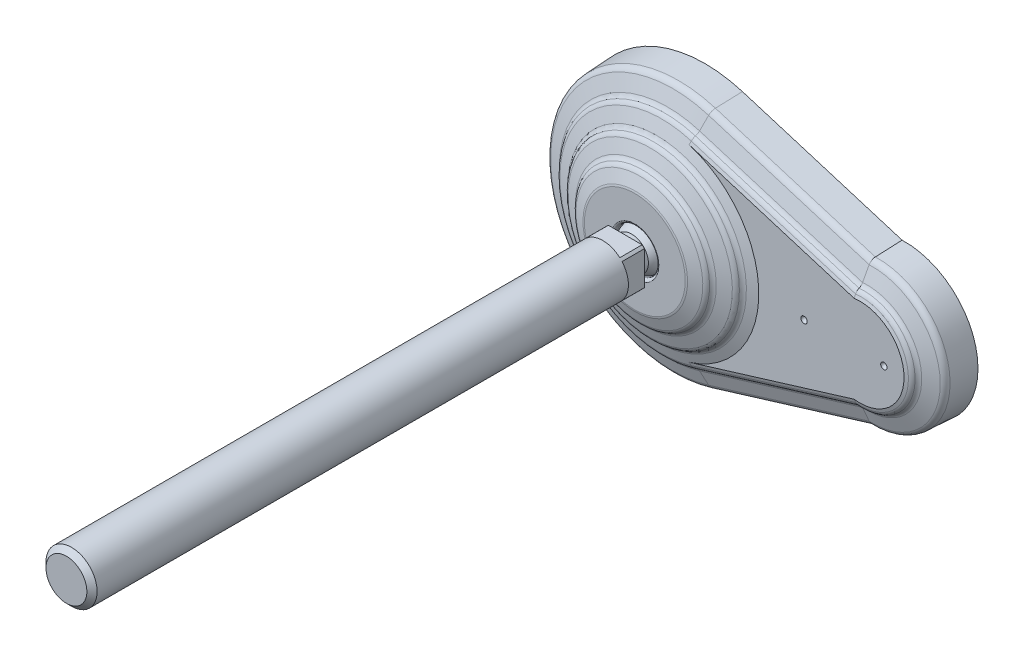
ISO-10303-21;
HEADER;
FILE_DESCRIPTION(('STEP AP214'),'2;1');
FILE_NAME('part.step','',(''),(''),'','','');
FILE_SCHEMA(('AUTOMOTIVE_DESIGN { 1 0 10303 214 1 1 1 1 }'));
ENDSEC;
DATA;
#1=APPLICATION_CONTEXT('core data for automotive mechanical design processes');
#2=APPLICATION_PROTOCOL_DEFINITION('international standard','automotive_design',2000,#1);
#3=PRODUCT_CONTEXT('',#1,'mechanical');
#4=PRODUCT('Part','Part','',(#3));
#5=PRODUCT_RELATED_PRODUCT_CATEGORY('part','',(#4));
#6=PRODUCT_DEFINITION_FORMATION('','',#4);
#7=PRODUCT_DEFINITION_CONTEXT('part definition',#1,'design');
#8=PRODUCT_DEFINITION('design','',#6,#7);
#9=PRODUCT_DEFINITION_SHAPE('','',#8);
#10=(LENGTH_UNIT() NAMED_UNIT(*) SI_UNIT(.MILLI.,.METRE.));
#11=(NAMED_UNIT(*) PLANE_ANGLE_UNIT() SI_UNIT($,.RADIAN.));
#12=(NAMED_UNIT(*) SI_UNIT($,.STERADIAN.) SOLID_ANGLE_UNIT());
#13=UNCERTAINTY_MEASURE_WITH_UNIT(LENGTH_MEASURE(1.E-05),#10,'distance_accuracy_value','');
#14=(GEOMETRIC_REPRESENTATION_CONTEXT(3) GLOBAL_UNCERTAINTY_ASSIGNED_CONTEXT((#13)) GLOBAL_UNIT_ASSIGNED_CONTEXT((#10,
#11,#12)) REPRESENTATION_CONTEXT('',''));
#15=CARTESIAN_POINT('',(0.,0.,0.));
#16=DIRECTION('',(0.,0.,1.));
#17=DIRECTION('',(1.,0.,0.));
#18=AXIS2_PLACEMENT_3D('',#15,#16,#17);
#19=CARTESIAN_POINT('',(0.,0.,32.));
#20=DIRECTION('',(0.,0.,1.));
#21=DIRECTION('',(-1.,0.,0.));
#22=AXIS2_PLACEMENT_3D('',#19,#20,#21);
#23=CYLINDRICAL_SURFACE('',#22,8.);
#24=CARTESIAN_POINT('',(0.,0.,198.4));
#25=DIRECTION('',(0.,0.,1.));
#26=DIRECTION('',(-1.,0.,0.));
#27=AXIS2_PLACEMENT_3D('',#24,#25,#26);
#28=CIRCLE('',#27,8.);
#29=CARTESIAN_POINT('',(-8.,0.,198.4));
#30=VERTEX_POINT('',#29);
#31=EDGE_CURVE('E9',#30,#30,#28,.F.);
#32=ORIENTED_EDGE('',*,*,#31,.T.);
#33=EDGE_LOOP('',(#32));
#34=FACE_BOUND('',#33,.T.);
#35=DIRECTION('',(0.,0.,1.));
#36=VECTOR('',#35,1.);
#37=CARTESIAN_POINT('',(-5.29150262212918,-6.,32.));
#38=LINE('',#37,#36);
#39=CARTESIAN_POINT('',(-5.29150262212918,-6.,32.));
#40=VERTEX_POINT('',#39);
#41=CARTESIAN_POINT('',(-5.29150262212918,-6.,25.));
#42=VERTEX_POINT('',#41);
#43=EDGE_CURVE('E399',#40,#42,#38,.F.);
#44=ORIENTED_EDGE('',*,*,#43,.F.);
#45=CARTESIAN_POINT('',(0.,0.,32.));
#46=DIRECTION('',(0.,0.,1.));
#47=DIRECTION('',(0.,-1.,0.));
#48=AXIS2_PLACEMENT_3D('',#45,#46,#47);
#49=CIRCLE('',#48,8.);
#50=CARTESIAN_POINT('',(5.29150262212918,-6.,32.));
#51=VERTEX_POINT('',#50);
#52=EDGE_CURVE('E486',#40,#51,#49,.T.);
#53=ORIENTED_EDGE('',*,*,#52,.T.);
#54=DIRECTION('',(0.,0.,1.));
#55=VECTOR('',#54,1.);
#56=CARTESIAN_POINT('',(5.29150262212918,-6.,32.));
#57=LINE('',#56,#55);
#58=CARTESIAN_POINT('',(5.29150262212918,-6.,25.));
#59=VERTEX_POINT('',#58);
#60=EDGE_CURVE('E404',#59,#51,#57,.T.);
#61=ORIENTED_EDGE('',*,*,#60,.F.);
#62=CARTESIAN_POINT('',(0.,0.,25.));
#63=DIRECTION('',(0.,0.,1.));
#64=DIRECTION('',(-1.,0.,0.));
#65=AXIS2_PLACEMENT_3D('',#62,#63,#64);
#66=CIRCLE('',#65,8.);
#67=CARTESIAN_POINT('',(6.,-5.29150262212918,25.));
#68=VERTEX_POINT('',#67);
#69=EDGE_CURVE('E522',#59,#68,#66,.T.);
#70=ORIENTED_EDGE('',*,*,#69,.T.);
#71=DIRECTION('',(0.,0.,1.));
#72=VECTOR('',#71,1.);
#73=CARTESIAN_POINT('',(6.,-5.29150262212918,32.));
#74=LINE('',#73,#72);
#75=CARTESIAN_POINT('',(6.,-5.29150262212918,32.));
#76=VERTEX_POINT('',#75);
#77=EDGE_CURVE('E407',#76,#68,#74,.F.);
#78=ORIENTED_EDGE('',*,*,#77,.F.);
#79=CARTESIAN_POINT('',(6.,5.29150262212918,32.));
#80=VERTEX_POINT('',#79);
#81=EDGE_CURVE('E401',#76,#80,#49,.T.);
#82=ORIENTED_EDGE('',*,*,#81,.T.);
#83=DIRECTION('',(0.,0.,1.));
#84=VECTOR('',#83,1.);
#85=CARTESIAN_POINT('',(6.,5.29150262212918,32.));
#86=LINE('',#85,#84);
#87=CARTESIAN_POINT('',(6.,5.29150262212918,25.));
#88=VERTEX_POINT('',#87);
#89=EDGE_CURVE('E417',#88,#80,#86,.T.);
#90=ORIENTED_EDGE('',*,*,#89,.F.);
#91=CARTESIAN_POINT('',(5.29150262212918,6.,25.));
#92=VERTEX_POINT('',#91);
#93=EDGE_CURVE('E520',#88,#92,#66,.T.);
#94=ORIENTED_EDGE('',*,*,#93,.T.);
#95=DIRECTION('',(0.,0.,1.));
#96=VECTOR('',#95,1.);
#97=CARTESIAN_POINT('',(5.29150262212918,6.,32.));
#98=LINE('',#97,#96);
#99=CARTESIAN_POINT('',(5.29150262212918,6.,32.));
#100=VERTEX_POINT('',#99);
#101=EDGE_CURVE('E420',#100,#92,#98,.F.);
#102=ORIENTED_EDGE('',*,*,#101,.F.);
#103=CARTESIAN_POINT('',(-5.29150262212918,6.,32.));
#104=VERTEX_POINT('',#103);
#105=EDGE_CURVE('E485',#100,#104,#49,.T.);
#106=ORIENTED_EDGE('',*,*,#105,.T.);
#107=DIRECTION('',(0.,0.,1.));
#108=VECTOR('',#107,1.);
#109=CARTESIAN_POINT('',(-5.29150262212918,6.,32.));
#110=LINE('',#109,#108);
#111=CARTESIAN_POINT('',(-5.29150262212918,6.,25.));
#112=VERTEX_POINT('',#111);
#113=EDGE_CURVE('E431',#112,#104,#110,.T.);
#114=ORIENTED_EDGE('',*,*,#113,.F.);
#115=CARTESIAN_POINT('',(-6.,5.29150262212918,25.));
#116=VERTEX_POINT('',#115);
#117=EDGE_CURVE('E445',#112,#116,#66,.T.);
#118=ORIENTED_EDGE('',*,*,#117,.T.);
#119=DIRECTION('',(0.,0.,1.));
#120=VECTOR('',#119,1.);
#121=CARTESIAN_POINT('',(-6.,5.29150262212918,32.));
#122=LINE('',#121,#120);
#123=CARTESIAN_POINT('',(-6.,5.29150262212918,32.));
#124=VERTEX_POINT('',#123);
#125=EDGE_CURVE('E434',#124,#116,#122,.F.);
#126=ORIENTED_EDGE('',*,*,#125,.F.);
#127=CARTESIAN_POINT('',(-6.,-5.29150262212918,32.));
#128=VERTEX_POINT('',#127);
#129=EDGE_CURVE('E480',#124,#128,#49,.T.);
#130=ORIENTED_EDGE('',*,*,#129,.T.);
#131=DIRECTION('',(0.,0.,1.));
#132=VECTOR('',#131,1.);
#133=CARTESIAN_POINT('',(-6.,-5.29150262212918,32.));
#134=LINE('',#133,#132);
#135=CARTESIAN_POINT('',(-6.,-5.29150262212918,25.));
#136=VERTEX_POINT('',#135);
#137=EDGE_CURVE('E443',#136,#128,#134,.T.);
#138=ORIENTED_EDGE('',*,*,#137,.F.);
#139=EDGE_CURVE('E388',#136,#42,#66,.T.);
#140=ORIENTED_EDGE('',*,*,#139,.T.);
#141=EDGE_LOOP('',(#44,#53,#61,#70,#78,#82,#90,#94,#102,#106,#114,#118,#126,#130,#138,#140));
#142=FACE_BOUND('',#141,.T.);
#143=ADVANCED_FACE('F14',(#34,#142),#23,.T.);
#144=CARTESIAN_POINT('',(64.1644462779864,-21.755748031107,8.30411735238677));
#145=DIRECTION('',(-0.291971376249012,0.9549953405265,-0.0523126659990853));
#146=DIRECTION('',(-0.956304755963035,-0.292371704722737,0.));
#147=AXIS2_PLACEMENT_3D('',#144,#145,#146);
#148=PLANE('',#147);
#149=CARTESIAN_POINT('',(61.6406997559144,-22.5273238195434,8.30431735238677));
#150=CARTESIAN_POINT('',(61.6501805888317,-22.600242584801,6.92023165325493));
#151=CARTESIAN_POINT('',(61.6596900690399,-22.6731526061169,5.53614569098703));
#152=CARTESIAN_POINT('',(61.6787663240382,-22.8189551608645,2.76797324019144));
#153=CARTESIAN_POINT('',(61.6883330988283,-22.8918476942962,1.38388675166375));
#154=CARTESIAN_POINT('',(61.6979285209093,-22.9647314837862,-0.000200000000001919));
#155=B_SPLINE_CURVE_WITH_KNOTS('',3,(#149,#150,#151,#152,#153,#154),.UNSPECIFIED.,.F.,.F.,(4,2,
4),(0.,4.15811282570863,8.31622565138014),.UNSPECIFIED.);
#156=CARTESIAN_POINT('',(61.6407011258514,-22.5273343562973,8.30411735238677));
#157=VERTEX_POINT('',#156);
#158=CARTESIAN_POINT('',(61.697927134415,-22.9647209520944,0.));
#159=VERTEX_POINT('',#158);
#160=EDGE_CURVE('E645',#157,#159,#155,.T.);
#161=ORIENTED_EDGE('',*,*,#160,.F.);
#162=DIRECTION('',(-0.956304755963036,-0.292371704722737,0.));
#163=VECTOR('',#162,1.);
#164=CARTESIAN_POINT('',(64.1644462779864,-21.755748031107,8.30411735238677));
#165=LINE('',#164,#163);
#166=CARTESIAN_POINT('',(11.5676847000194,-37.8361917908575,8.30411735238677));
#167=VERTEX_POINT('',#166);
#168=EDGE_CURVE('E644',#157,#167,#165,.T.);
#169=ORIENTED_EDGE('',*,*,#168,.T.);
#170=DIRECTION('',(-0.0152947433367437,0.050026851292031,0.998630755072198));
#171=VECTOR('',#170,1.);
#172=CARTESIAN_POINT('',(11.6948681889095,-38.2521902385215,0.));
#173=LINE('',#172,#171);
#174=CARTESIAN_POINT('',(11.6948681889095,-38.2521902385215,0.));
#175=VERTEX_POINT('',#174);
#176=EDGE_CURVE('E585',#175,#167,#173,.T.);
#177=ORIENTED_EDGE('',*,*,#176,.F.);
#178=DIRECTION('',(-0.956304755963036,-0.292371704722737,0.));
#179=VECTOR('',#178,1.);
#180=CARTESIAN_POINT('',(64.2916297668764,-22.1717464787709,0.));
#181=LINE('',#180,#179);
#182=EDGE_CURVE('E31',#159,#175,#181,.T.);
#183=ORIENTED_EDGE('',*,*,#182,.F.);
#184=EDGE_LOOP('',(#161,#169,#177,#183));
#185=FACE_BOUND('',#184,.T.);
#186=ADVANCED_FACE('F338',(#185),#148,.F.);
#187=CARTESIAN_POINT('',(61.6120778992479,-13.407327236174,14.));
#188=DIRECTION('',(-0.102070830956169,0.333858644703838,-0.937080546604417));
#189=DIRECTION('',(0.,0.942000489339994,0.335611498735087));
#190=AXIS2_PLACEMENT_3D('',#187,#188,#189);
#191=PLANE('',#190);
#192=CARTESIAN_POINT('',(60.6773763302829,-13.6925328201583,14.0002));
#193=CARTESIAN_POINT('',(60.6914441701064,-13.863175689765,13.9378718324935));
#194=CARTESIAN_POINT('',(60.7058313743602,-14.0337829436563,13.8755215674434));
#195=CARTESIAN_POINT('',(60.735244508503,-14.3749261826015,13.7507768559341));
#196=CARTESIAN_POINT('',(60.750270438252,-14.5454621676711,13.6883824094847));
#197=CARTESIAN_POINT('',(60.7656157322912,-14.7159625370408,13.6259658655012));
#198=B_SPLINE_CURVE_WITH_KNOTS('',3,(#192,#193,#194,#195,#196,#197),.UNSPECIFIED.,.F.,.F.,(4,2,
4),(0.,0.546637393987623,1.09327466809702),.UNSPECIFIED.);
#199=CARTESIAN_POINT('',(60.677421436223,-13.6930803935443,14.));
#200=VERTEX_POINT('',#199);
#201=CARTESIAN_POINT('',(60.765566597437,-14.7154161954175,13.6261658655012));
#202=VERTEX_POINT('',#201);
#203=EDGE_CURVE('E168',#200,#202,#198,.T.);
#204=ORIENTED_EDGE('',*,*,#203,.F.);
#205=DIRECTION('',(-0.956304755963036,-0.292371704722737,0.));
#206=VECTOR('',#205,1.);
#207=CARTESIAN_POINT('',(61.6120778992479,-13.407327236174,14.));
#208=LINE('',#207,#206);
#209=CARTESIAN_POINT('',(9.01531632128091,-29.4877709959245,14.));
#210=VERTEX_POINT('',#209);
#211=EDGE_CURVE('E172',#200,#210,#208,.T.);
#212=ORIENTED_EDGE('',*,*,#211,.T.);
#213=DIRECTION('',(-0.273975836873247,0.896134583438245,0.349113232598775));
#214=VECTOR('',#213,1.);
#215=CARTESIAN_POINT('',(9.30869253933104,-30.4473613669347,13.6261658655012));
#216=LINE('',#215,#214);
#217=CARTESIAN_POINT('',(9.30869253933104,-30.4473613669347,13.6261658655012));
#218=VERTEX_POINT('',#217);
#219=EDGE_CURVE('E171',#218,#210,#216,.T.);
#220=ORIENTED_EDGE('',*,*,#219,.F.);
#221=DIRECTION('',(-0.956304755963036,-0.292371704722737,0.));
#222=VECTOR('',#221,1.);
#223=CARTESIAN_POINT('',(61.905454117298,-14.3669176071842,13.6261658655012));
#224=LINE('',#223,#222);
#225=EDGE_CURVE('E155',#202,#218,#224,.T.);
#226=ORIENTED_EDGE('',*,*,#225,.F.);
#227=EDGE_LOOP('',(#204,#212,#220,#226));
#228=FACE_BOUND('',#227,.T.);
#229=ADVANCED_FACE('F167',(#228),#191,.F.);
#230=CARTESIAN_POINT('',(62.7507979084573,-17.131912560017,13.5370123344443));
#231=DIRECTION('',(-0.956304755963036,-0.292371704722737,0.));
#232=DIRECTION('',(0.292371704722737,-0.956304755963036,0.));
#233=AXIS2_PLACEMENT_3D('',#230,#231,#232);
#234=CYLINDRICAL_SURFACE('',#233,2.00700000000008);
#235=DIRECTION('',(-0.956304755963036,-0.292371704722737,0.));
#236=VECTOR('',#235,1.);
#237=CARTESIAN_POINT('',(62.545973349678,-16.4619616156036,11.656251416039));
#238=LINE('',#237,#236);
#239=CARTESIAN_POINT('',(60.9818619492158,-16.9401584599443,11.656251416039));
#240=VERTEX_POINT('',#239);
#241=CARTESIAN_POINT('',(9.949211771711,-32.5424053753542,11.656251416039));
#242=VERTEX_POINT('',#241);
#243=EDGE_CURVE('E650',#240,#242,#238,.T.);
#244=ORIENTED_EDGE('',*,*,#243,.F.);
#245=CARTESIAN_POINT('',(60.9819185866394,-16.9407028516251,11.656051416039));
#246=CARTESIAN_POINT('',(60.9763282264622,-16.8869710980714,11.675784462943));
#247=CARTESIAN_POINT('',(60.9708503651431,-16.8340792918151,11.697757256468));
#248=CARTESIAN_POINT('',(60.9601474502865,-16.7302929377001,11.7460604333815));
#249=CARTESIAN_POINT('',(60.9549224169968,-16.6793985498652,11.77239116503));
#250=CARTESIAN_POINT('',(60.9396574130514,-16.5300811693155,11.8578002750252));
#251=CARTESIAN_POINT('',(60.9300410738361,-16.4351542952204,11.9232476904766));
#252=CARTESIAN_POINT('',(60.9121877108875,-16.2575900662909,12.0693279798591));
#253=CARTESIAN_POINT('',(60.9039521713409,-16.1749659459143,12.1499769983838));
#254=CARTESIAN_POINT('',(60.8890756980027,-16.0247595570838,12.3241094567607));
#255=CARTESIAN_POINT('',(60.8824301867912,-15.9571341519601,12.4175548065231));
#256=CARTESIAN_POINT('',(60.8754548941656,-15.8858007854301,12.5364334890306));
#257=CARTESIAN_POINT('',(60.8742920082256,-15.8738939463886,12.5571086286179));
#258=CARTESIAN_POINT('',(60.8720425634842,-15.8508368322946,12.59885583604));
#259=CARTESIAN_POINT('',(60.8709559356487,-15.839685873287,12.6199275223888));
#260=CARTESIAN_POINT('',(60.869906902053,-15.8289098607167,12.6412000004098));
#261=B_SPLINE_CURVE_WITH_KNOTS('',3,(#245,#246,#247,#248,#249,#250,#251,#252,#253,#254,#255,
#256,#257,#258,#259,#260),.UNSPECIFIED.,.F.,.F.,(4,2,2,2,2,2,2,4),(0.,0.172434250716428,
0.34488228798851,0.690191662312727,1.0358698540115,1.38054058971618,1.4521941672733,
1.52378201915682),.UNSPECIFIED.);
#262=CARTESIAN_POINT('',(60.8699167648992,-15.8290111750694,12.6410000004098));
#263=VERTEX_POINT('',#262);
#264=EDGE_CURVE('E266',#240,#263,#261,.T.);
#265=ORIENTED_EDGE('',*,*,#264,.T.);
#266=DIRECTION('',(-0.956304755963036,-0.292371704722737,0.));
#267=VECTOR('',#266,1.);
#268=CARTESIAN_POINT('',(62.2257313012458,-15.4144970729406,12.6410000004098));
#269=LINE('',#268,#267);
#270=CARTESIAN_POINT('',(9.62896972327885,-31.4949408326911,12.6410000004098));
#271=VERTEX_POINT('',#270);
#272=EDGE_CURVE('E157',#263,#271,#269,.T.);
#273=ORIENTED_EDGE('',*,*,#272,.T.);
#274=CARTESIAN_POINT('',(10.1540363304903,-33.2123563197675,13.5370123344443));
#275=DIRECTION('',(0.956304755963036,0.292371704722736,0.));
#276=DIRECTION('',(-0.292371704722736,0.956304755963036,0.));
#277=AXIS2_PLACEMENT_3D('',#274,#275,#276);
#278=CIRCLE('',#277,2.00700000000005);
#279=EDGE_CURVE('E597',#242,#271,#278,.T.);
#280=ORIENTED_EDGE('',*,*,#279,.F.);
#281=EDGE_LOOP('',(#244,#265,#273,#280));
#282=FACE_BOUND('',#281,.T.);
#283=ADVANCED_FACE('F317',(#282),#234,.F.);
#284=CARTESIAN_POINT('',(62.545973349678,-16.4619616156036,11.656251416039));
#285=DIRECTION('',(-0.102055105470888,0.333807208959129,-0.937100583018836));
#286=DIRECTION('',(0.,0.942019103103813,0.335559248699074));
#287=AXIS2_PLACEMENT_3D('',#284,#285,#286);
#288=PLANE('',#287);
#289=CARTESIAN_POINT('',(60.9818053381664,-16.9396143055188,11.656451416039));
#290=CARTESIAN_POINT('',(61.0189355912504,-17.2964789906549,11.5252879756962));
#291=CARTESIAN_POINT('',(61.0571375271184,-17.653206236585,11.3940567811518));
#292=CARTESIAN_POINT('',(61.1355151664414,-18.3663907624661,11.1314756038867));
#293=CARTESIAN_POINT('',(61.1756908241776,-18.7228480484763,11.0001256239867));
#294=CARTESIAN_POINT('',(61.2578477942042,-19.435511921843,10.7373183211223));
#295=CARTESIAN_POINT('',(61.2998290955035,-19.7917185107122,10.6058609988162));
#296=CARTESIAN_POINT('',(61.3854616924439,-20.5039033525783,10.3428458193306));
#297=CARTESIAN_POINT('',(61.4291130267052,-20.8598816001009,10.2112879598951));
#298=CARTESIAN_POINT('',(61.4735304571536,-21.2157475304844,10.0796866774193));
#299=B_SPLINE_CURVE_WITH_KNOTS('',3,(#289,#290,#291,#292,#293,#294,#295,#296,#297,#298),
.UNSPECIFIED.,.F.,.F.,(4,2,2,2,4),(0.,1.14603990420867,2.29205327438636,3.43805966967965,
4.58409258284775),.UNSPECIFIED.);
#300=CARTESIAN_POINT('',(61.4734629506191,-21.2152067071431,10.0798866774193));
#301=VERTEX_POINT('',#300);
#302=EDGE_CURVE('E298',#240,#301,#299,.T.);
#303=ORIENTED_EDGE('',*,*,#302,.F.);
#304=ORIENTED_EDGE('',*,*,#243,.T.);
#305=DIRECTION('',(-0.273981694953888,0.896153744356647,0.349059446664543));
#306=VECTOR('',#305,1.);
#307=CARTESIAN_POINT('',(11.1865227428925,-36.5894672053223,10.0798866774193));
#308=LINE('',#307,#306);
#309=CARTESIAN_POINT('',(11.1865227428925,-36.5894672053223,10.0798866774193));
#310=VERTEX_POINT('',#309);
#311=EDGE_CURVE('E594',#310,#242,#308,.T.);
#312=ORIENTED_EDGE('',*,*,#311,.F.);
#313=DIRECTION('',(-0.956304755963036,-0.292371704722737,0.));
#314=VECTOR('',#313,1.);
#315=CARTESIAN_POINT('',(63.7832843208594,-20.5090234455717,10.0798866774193));
#316=LINE('',#315,#314);
#317=EDGE_CURVE('E647',#301,#310,#316,.T.);
#318=ORIENTED_EDGE('',*,*,#317,.F.);
#319=EDGE_LOOP('',(#303,#304,#312,#318));
#320=FACE_BOUND('',#319,.T.);
#321=ADVANCED_FACE('F312',(#320),#288,.F.);
#322=CARTESIAN_POINT('',(64.2916297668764,22.1717464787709,0.));
#323=DIRECTION('',(-0.291971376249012,-0.9549953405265,-0.0523126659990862));
#324=DIRECTION('',(0.956304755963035,-0.292371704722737,0.));
#325=AXIS2_PLACEMENT_3D('',#322,#323,#324);
#326=PLANE('',#325);
#327=CARTESIAN_POINT('',(61.6979285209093,22.9647314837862,-0.000199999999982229));
#328=CARTESIAN_POINT('',(61.6883330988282,22.8918476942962,1.38388675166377));
#329=CARTESIAN_POINT('',(61.6787663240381,22.8189551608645,2.76797324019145));
#330=CARTESIAN_POINT('',(61.6596900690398,22.6731526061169,5.53614569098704));
#331=CARTESIAN_POINT('',(61.6501805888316,22.600242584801,6.92023165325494));
#332=CARTESIAN_POINT('',(61.6406997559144,22.5273238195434,8.30431735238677));
#333=B_SPLINE_CURVE_WITH_KNOTS('',3,(#327,#328,#329,#330,#331,#332),.UNSPECIFIED.,.F.,.F.,(4,2,
4),(0.,4.1581128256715,8.31622565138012),.UNSPECIFIED.);
#334=CARTESIAN_POINT('',(61.6979271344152,22.9647209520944,0.));
#335=VERTEX_POINT('',#334);
#336=CARTESIAN_POINT('',(61.6407011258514,22.5273343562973,8.30411735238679));
#337=VERTEX_POINT('',#336);
#338=EDGE_CURVE('E694',#335,#337,#333,.T.);
#339=ORIENTED_EDGE('',*,*,#338,.F.);
#340=DIRECTION('',(-0.956304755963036,0.292371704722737,0.));
#341=VECTOR('',#340,1.);
#342=CARTESIAN_POINT('',(64.2916297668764,22.1717464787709,0.));
#343=LINE('',#342,#341);
#344=CARTESIAN_POINT('',(11.6948681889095,38.2521902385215,0.));
#345=VERTEX_POINT('',#344);
#346=EDGE_CURVE('E648',#335,#345,#343,.T.);
#347=ORIENTED_EDGE('',*,*,#346,.T.);
#348=DIRECTION('',(-0.0152947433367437,-0.050026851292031,0.998630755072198));
#349=VECTOR('',#348,1.);
#350=CARTESIAN_POINT('',(11.6948681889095,38.2521902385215,0.));
#351=LINE('',#350,#349);
#352=CARTESIAN_POINT('',(11.5676847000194,37.8361917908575,8.30411735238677));
#353=VERTEX_POINT('',#352);
#354=EDGE_CURVE('E603',#345,#353,#351,.T.);
#355=ORIENTED_EDGE('',*,*,#354,.T.);
#356=DIRECTION('',(-0.956304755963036,0.292371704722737,0.));
#357=VECTOR('',#356,1.);
#358=CARTESIAN_POINT('',(64.1644462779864,21.755748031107,8.30411735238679));
#359=LINE('',#358,#357);
#360=EDGE_CURVE('E652',#337,#353,#359,.T.);
#361=ORIENTED_EDGE('',*,*,#360,.F.);
#362=EDGE_LOOP('',(#339,#347,#355,#361));
#363=FACE_BOUND('',#362,.T.);
#364=ADVANCED_FACE('F316',(#363),#326,.F.);
#365=CARTESIAN_POINT('',(63.7832843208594,20.5090234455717,10.0798866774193));
#366=DIRECTION('',(-0.102055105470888,-0.333807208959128,-0.937100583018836));
#367=DIRECTION('',(0.,0.942019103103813,-0.335559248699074));
#368=AXIS2_PLACEMENT_3D('',#365,#366,#367);
#369=PLANE('',#368);
#370=CARTESIAN_POINT('',(61.4735304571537,21.2157475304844,10.0796866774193));
#371=CARTESIAN_POINT('',(61.4291130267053,20.8598816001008,10.2112879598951));
#372=CARTESIAN_POINT('',(61.3854616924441,20.5039033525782,10.3428458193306));
#373=CARTESIAN_POINT('',(61.2998290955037,19.7917185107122,10.6058609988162));
#374=CARTESIAN_POINT('',(61.2578477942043,19.435511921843,10.7373183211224));
#375=CARTESIAN_POINT('',(61.1756908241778,18.7228480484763,11.0001256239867));
#376=CARTESIAN_POINT('',(61.1355151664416,18.3663907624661,11.1314756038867));
#377=CARTESIAN_POINT('',(61.0571375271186,17.653206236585,11.3940567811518));
#378=CARTESIAN_POINT('',(61.0189355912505,17.2964789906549,11.5252879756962));
#379=CARTESIAN_POINT('',(60.9818053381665,16.9396143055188,11.656451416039));
#380=B_SPLINE_CURVE_WITH_KNOTS('',3,(#370,#371,#372,#373,#374,#375,#376,#377,#378,#379),
.UNSPECIFIED.,.F.,.F.,(4,2,2,2,4),(0.,1.1460329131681,2.29203930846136,3.43805267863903,
4.58409258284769),.UNSPECIFIED.);
#381=CARTESIAN_POINT('',(61.4734629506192,21.2152067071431,10.0798866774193));
#382=VERTEX_POINT('',#381);
#383=CARTESIAN_POINT('',(60.9818619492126,16.9401584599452,11.656251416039));
#384=VERTEX_POINT('',#383);
#385=EDGE_CURVE('E292',#382,#384,#380,.T.);
#386=ORIENTED_EDGE('',*,*,#385,.F.);
#387=DIRECTION('',(-0.956304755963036,0.292371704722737,0.));
#388=VECTOR('',#387,1.);
#389=CARTESIAN_POINT('',(63.7832843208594,20.5090234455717,10.0798866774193));
#390=LINE('',#389,#388);
#391=CARTESIAN_POINT('',(11.1865227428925,36.5894672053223,10.0798866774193));
#392=VERTEX_POINT('',#391);
#393=EDGE_CURVE('E683',#382,#392,#390,.T.);
#394=ORIENTED_EDGE('',*,*,#393,.T.);
#395=DIRECTION('',(-0.273981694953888,-0.896153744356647,0.349059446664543));
#396=VECTOR('',#395,1.);
#397=CARTESIAN_POINT('',(11.1865227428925,36.5894672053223,10.0798866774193));
#398=LINE('',#397,#396);
#399=CARTESIAN_POINT('',(9.949211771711,32.5424053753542,11.656251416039));
#400=VERTEX_POINT('',#399);
#401=EDGE_CURVE('E609',#392,#400,#398,.T.);
#402=ORIENTED_EDGE('',*,*,#401,.T.);
#403=DIRECTION('',(-0.956304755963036,0.292371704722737,0.));
#404=VECTOR('',#403,1.);
#405=CARTESIAN_POINT('',(62.545973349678,16.4619616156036,11.656251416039));
#406=LINE('',#405,#404);
#407=EDGE_CURVE('E684',#384,#400,#406,.T.);
#408=ORIENTED_EDGE('',*,*,#407,.F.);
#409=EDGE_LOOP('',(#386,#394,#402,#408));
#410=FACE_BOUND('',#409,.T.);
#411=ADVANCED_FACE('F255',(#410),#369,.F.);
#412=CARTESIAN_POINT('',(62.7507979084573,17.1319125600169,13.5370123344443));
#413=DIRECTION('',(-0.956304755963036,0.292371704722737,0.));
#414=DIRECTION('',(-0.292371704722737,-0.956304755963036,0.));
#415=AXIS2_PLACEMENT_3D('',#412,#413,#414);
#416=CYLINDRICAL_SURFACE('',#415,2.007);
#417=DIRECTION('',(-0.956304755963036,0.292371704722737,0.));
#418=VECTOR('',#417,1.);
#419=CARTESIAN_POINT('',(62.2257313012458,15.4144970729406,12.6410000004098));
#420=LINE('',#419,#418);
#421=CARTESIAN_POINT('',(60.8699167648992,15.8290111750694,12.6410000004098));
#422=VERTEX_POINT('',#421);
#423=CARTESIAN_POINT('',(9.62896972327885,31.4949408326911,12.6410000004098));
#424=VERTEX_POINT('',#423);
#425=EDGE_CURVE('E773',#422,#424,#420,.T.);
#426=ORIENTED_EDGE('',*,*,#425,.F.);
#427=CARTESIAN_POINT('',(60.869906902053,15.8289098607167,12.6412000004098));
#428=CARTESIAN_POINT('',(60.8724049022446,15.8545692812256,12.5905409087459));
#429=CARTESIAN_POINT('',(60.8751177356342,15.882373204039,12.5410120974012));
#430=CARTESIAN_POINT('',(60.8809599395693,15.9420653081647,12.4445128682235));
#431=CARTESIAN_POINT('',(60.8840892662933,15.9739530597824,12.3975421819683));
#432=CARTESIAN_POINT('',(60.8940798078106,16.0754098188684,12.2609440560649));
#433=CARTESIAN_POINT('',(60.9015461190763,16.1507985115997,12.1755790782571));
#434=CARTESIAN_POINT('',(60.9179069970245,16.3146445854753,12.0187596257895));
#435=CARTESIAN_POINT('',(60.9268017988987,16.4031041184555,11.9473074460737));
#436=CARTESIAN_POINT('',(60.9458071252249,16.5904449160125,11.8202080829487));
#437=CARTESIAN_POINT('',(60.9559150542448,16.6893038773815,11.7645279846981));
#438=CARTESIAN_POINT('',(60.9690169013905,16.8162843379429,11.7062217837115));
#439=CARTESIAN_POINT('',(60.9715630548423,16.8409104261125,11.6954970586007));
#440=CARTESIAN_POINT('',(60.9767040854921,16.8905299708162,11.6750365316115));
#441=CARTESIAN_POINT('',(60.9792989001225,16.9155229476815,11.6652995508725));
#442=CARTESIAN_POINT('',(60.9819185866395,16.940702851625,11.656051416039));
#443=B_SPLINE_CURVE_WITH_KNOTS('',3,(#427,#428,#429,#430,#431,#432,#433,#434,#435,#436,#437,
#438,#439,#440,#441,#442),.UNSPECIFIED.,.F.,.F.,(4,2,2,2,2,2,2,4),(0.,0.170415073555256,
0.340812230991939,0.681435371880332,1.0221146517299,1.36207763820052,1.44300799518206,
1.52384059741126),.UNSPECIFIED.);
#444=EDGE_CURVE('E161',#422,#384,#443,.T.);
#445=ORIENTED_EDGE('',*,*,#444,.T.);
#446=ORIENTED_EDGE('',*,*,#407,.T.);
#447=CARTESIAN_POINT('',(10.1540363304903,33.2123563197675,13.5370123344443));
#448=DIRECTION('',(-0.956304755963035,0.292371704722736,0.));
#449=DIRECTION('',(-0.292371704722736,-0.956304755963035,0.));
#450=AXIS2_PLACEMENT_3D('',#447,#448,#449);
#451=CIRCLE('',#450,2.00700000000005);
#452=EDGE_CURVE('E612',#400,#424,#451,.T.);
#453=ORIENTED_EDGE('',*,*,#452,.T.);
#454=EDGE_LOOP('',(#426,#445,#446,#453));
#455=FACE_BOUND('',#454,.T.);
#456=ADVANCED_FACE('F242',(#455),#416,.F.);
#457=CARTESIAN_POINT('',(61.905454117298,14.3669176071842,13.6261658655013));
#458=DIRECTION('',(-0.102070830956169,-0.333858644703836,-0.937080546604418));
#459=DIRECTION('',(0.,0.942000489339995,-0.335611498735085));
#460=AXIS2_PLACEMENT_3D('',#457,#458,#459);
#461=PLANE('',#460);
#462=CARTESIAN_POINT('',(60.7656157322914,14.7159625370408,13.6259658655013));
#463=CARTESIAN_POINT('',(60.7502704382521,14.5454621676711,13.6883824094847));
#464=CARTESIAN_POINT('',(60.735244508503,14.3749261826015,13.7507768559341));
#465=CARTESIAN_POINT('',(60.7058313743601,14.0337829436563,13.8755215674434));
#466=CARTESIAN_POINT('',(60.6914441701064,13.863175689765,13.9378718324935));
#467=CARTESIAN_POINT('',(60.6773763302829,13.6925328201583,14.0002));
#468=B_SPLINE_CURVE_WITH_KNOTS('',3,(#462,#463,#464,#465,#466,#467),.UNSPECIFIED.,.F.,.F.,(4,2,
4),(0.,0.546637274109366,1.09327466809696),.UNSPECIFIED.);
#469=CARTESIAN_POINT('',(60.7655665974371,14.7154161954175,13.6261658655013));
#470=VERTEX_POINT('',#469);
#471=CARTESIAN_POINT('',(60.6774214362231,13.6930803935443,14.));
#472=VERTEX_POINT('',#471);
#473=EDGE_CURVE('E225',#470,#472,#468,.T.);
#474=ORIENTED_EDGE('',*,*,#473,.F.);
#475=DIRECTION('',(-0.956304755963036,0.292371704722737,0.));
#476=VECTOR('',#475,1.);
#477=CARTESIAN_POINT('',(61.905454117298,14.3669176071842,13.6261658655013));
#478=LINE('',#477,#476);
#479=CARTESIAN_POINT('',(9.30869253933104,30.4473613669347,13.6261658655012));
#480=VERTEX_POINT('',#479);
#481=EDGE_CURVE('E771',#470,#480,#478,.T.);
#482=ORIENTED_EDGE('',*,*,#481,.T.);
#483=DIRECTION('',(-0.273975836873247,-0.896134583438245,0.349113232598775));
#484=VECTOR('',#483,1.);
#485=CARTESIAN_POINT('',(9.30869253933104,30.4473613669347,13.6261658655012));
#486=LINE('',#485,#484);
#487=CARTESIAN_POINT('',(9.01531632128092,29.4877709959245,14.));
#488=VERTEX_POINT('',#487);
#489=EDGE_CURVE('E618',#480,#488,#486,.T.);
#490=ORIENTED_EDGE('',*,*,#489,.T.);
#491=DIRECTION('',(-0.956304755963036,0.292371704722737,0.));
#492=VECTOR('',#491,1.);
#493=CARTESIAN_POINT('',(61.6120778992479,13.4073272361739,14.));
#494=LINE('',#493,#492);
#495=EDGE_CURVE('E75',#472,#488,#494,.T.);
#496=ORIENTED_EDGE('',*,*,#495,.F.);
#497=EDGE_LOOP('',(#474,#482,#490,#496));
#498=FACE_BOUND('',#497,.T.);
#499=ADVANCED_FACE('F237',(#498),#461,.F.);
#500=CARTESIAN_POINT('',(0.,0.,0.));
#501=DIRECTION('',(0.,0.,1.));
#502=DIRECTION('',(-1.,0.,0.));
#503=AXIS2_PLACEMENT_3D('',#500,#501,#502);
#504=PLANE('',#503);
#505=ORIENTED_EDGE('',*,*,#346,.F.);
#506=CARTESIAN_POINT('',(62.5,0.,0.));
#507=DIRECTION('',(0.,0.,1.));
#508=DIRECTION('',(0.,-1.,0.));
#509=AXIS2_PLACEMENT_3D('',#506,#507,#508);
#510=CIRCLE('',#509,22.9787234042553);
#511=EDGE_CURVE('E181',#159,#335,#510,.T.);
#512=ORIENTED_EDGE('',*,*,#511,.F.);
#513=ORIENTED_EDGE('',*,*,#182,.T.);
#514=CARTESIAN_POINT('',(0.,0.,0.));
#515=DIRECTION('',(0.,0.,1.));
#516=DIRECTION('',(-1.,0.,0.));
#517=AXIS2_PLACEMENT_3D('',#514,#515,#516);
#518=CIRCLE('',#517,40.);
#519=EDGE_CURVE('E233',#345,#175,#518,.T.);
#520=ORIENTED_EDGE('',*,*,#519,.F.);
#521=EDGE_LOOP('',(#505,#512,#513,#520));
#522=FACE_BOUND('',#521,.T.);
#523=CARTESIAN_POINT('',(70.,0.,0.));
#524=DIRECTION('',(0.,0.,-1.));
#525=DIRECTION('',(0.,1.,0.));
#526=AXIS2_PLACEMENT_3D('',#523,#524,#525);
#527=CIRCLE('',#526,5.25);
#528=CARTESIAN_POINT('',(70.,5.25,0.));
#529=VERTEX_POINT('',#528);
#530=EDGE_CURVE('E491',#529,#529,#527,.T.);
#531=ORIENTED_EDGE('',*,*,#530,.F.);
#532=EDGE_LOOP('',(#531));
#533=FACE_BOUND('',#532,.T.);
#534=CARTESIAN_POINT('',(45.,0.,0.));
#535=DIRECTION('',(0.,0.,-1.));
#536=DIRECTION('',(0.,1.,0.));
#537=AXIS2_PLACEMENT_3D('',#534,#535,#536);
#538=CIRCLE('',#537,5.25);
#539=CARTESIAN_POINT('',(45.,5.25,0.));
#540=VERTEX_POINT('',#539);
#541=EDGE_CURVE('E1165',#540,#540,#538,.T.);
#542=ORIENTED_EDGE('',*,*,#541,.F.);
#543=EDGE_LOOP('',(#542));
#544=FACE_BOUND('',#543,.T.);
#545=ADVANCED_FACE('F241',(#522,#533,#544),#504,.F.);
#546=CARTESIAN_POINT('',(0.,0.,0.));
#547=DIRECTION('',(0.,0.,-1.));
#548=DIRECTION('',(1.,0.,0.));
#549=AXIS2_PLACEMENT_3D('',#546,#547,#548);
#550=CONICAL_SURFACE('',#549,40.,0.0523365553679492);
#551=CARTESIAN_POINT('',(0.,0.,8.30411735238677));
#552=DIRECTION('',(0.,0.,1.));
#553=DIRECTION('',(-1.,0.,0.));
#554=AXIS2_PLACEMENT_3D('',#551,#552,#553);
#555=CIRCLE('',#554,39.5649938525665);
#556=EDGE_CURVE('E631',#353,#167,#555,.T.);
#557=ORIENTED_EDGE('',*,*,#556,.F.);
#558=ORIENTED_EDGE('',*,*,#354,.F.);
#559=ORIENTED_EDGE('',*,*,#519,.T.);
#560=ORIENTED_EDGE('',*,*,#176,.T.);
#561=EDGE_LOOP('',(#557,#558,#559,#560));
#562=FACE_BOUND('',#561,.T.);
#563=ADVANCED_FACE('F640',(#562),#550,.T.);
#564=CARTESIAN_POINT('',(0.,0.,8.19912580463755));
#565=DIRECTION('',(0.,0.,1.));
#566=DIRECTION('',(-1.,0.,0.));
#567=AXIS2_PLACEMENT_3D('',#564,#565,#566);
#568=TOROIDAL_SURFACE('',#567,37.5607419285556,2.007);
#569=CARTESIAN_POINT('',(0.,0.,10.0798866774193));
#570=DIRECTION('',(0.,0.,1.));
#571=DIRECTION('',(-1.,0.,0.));
#572=AXIS2_PLACEMENT_3D('',#569,#570,#571);
#573=CIRCLE('',#572,38.2613042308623);
#574=EDGE_CURVE('E629',#392,#310,#573,.T.);
#575=ORIENTED_EDGE('',*,*,#574,.F.);
#576=CARTESIAN_POINT('',(10.9816981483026,35.9195161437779,8.19912580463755));
#577=DIRECTION('',(-0.956304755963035,0.292371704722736,0.));
#578=DIRECTION('',(-0.292371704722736,-0.956304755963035,0.));
#579=AXIS2_PLACEMENT_3D('',#576,#577,#578);
#580=CIRCLE('',#579,2.007);
#581=EDGE_CURVE('E606',#392,#353,#580,.T.);
#582=ORIENTED_EDGE('',*,*,#581,.T.);
#583=ORIENTED_EDGE('',*,*,#556,.T.);
#584=CARTESIAN_POINT('',(10.9816981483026,-35.9195161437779,8.19912580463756));
#585=DIRECTION('',(0.956304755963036,0.292371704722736,0.));
#586=DIRECTION('',(-0.292371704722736,0.956304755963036,0.));
#587=AXIS2_PLACEMENT_3D('',#584,#585,#586);
#588=CIRCLE('',#587,2.007);
#589=EDGE_CURVE('E591',#310,#167,#588,.T.);
#590=ORIENTED_EDGE('',*,*,#589,.F.);
#591=EDGE_LOOP('',(#575,#582,#583,#590));
#592=FACE_BOUND('',#591,.T.);
#593=ADVANCED_FACE('F777',(#592),#568,.T.);
#594=CARTESIAN_POINT('',(0.,0.,10.0798866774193));
#595=DIRECTION('',(0.,0.,-1.));
#596=DIRECTION('',(1.,0.,0.));
#597=AXIS2_PLACEMENT_3D('',#594,#595,#596);
#598=CONICAL_SURFACE('',#597,38.2613042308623,1.21422909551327);
#599=CARTESIAN_POINT('',(0.,0.,11.656251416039));
#600=DIRECTION('',(0.,0.,1.));
#601=DIRECTION('',(-1.,0.,0.));
#602=AXIS2_PLACEMENT_3D('',#599,#600,#601);
#603=CIRCLE('',#602,34.0293250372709);
#604=EDGE_CURVE('E626',#400,#242,#603,.T.);
#605=ORIENTED_EDGE('',*,*,#604,.F.);
#606=ORIENTED_EDGE('',*,*,#401,.F.);
#607=ORIENTED_EDGE('',*,*,#574,.T.);
#608=ORIENTED_EDGE('',*,*,#311,.T.);
#609=EDGE_LOOP('',(#605,#606,#607,#608));
#610=FACE_BOUND('',#609,.T.);
#611=ADVANCED_FACE('F672',(#610),#598,.T.);
#612=CARTESIAN_POINT('',(0.,0.,13.5370123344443));
#613=DIRECTION('',(0.,0.,1.));
#614=DIRECTION('',(-1.,0.,0.));
#615=AXIS2_PLACEMENT_3D('',#612,#613,#614);
#616=TOROIDAL_SURFACE('',#615,34.7298872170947,2.00700000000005);
#617=CARTESIAN_POINT('',(0.,0.,12.6410000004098));
#618=DIRECTION('',(0.,0.,1.));
#619=DIRECTION('',(-1.,0.,0.));
#620=AXIS2_PLACEMENT_3D('',#617,#618,#619);
#621=CIRCLE('',#620,32.9339999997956);
#622=EDGE_CURVE('E623',#424,#271,#621,.T.);
#623=ORIENTED_EDGE('',*,*,#622,.F.);
#624=ORIENTED_EDGE('',*,*,#452,.F.);
#625=ORIENTED_EDGE('',*,*,#604,.T.);
#626=ORIENTED_EDGE('',*,*,#279,.T.);
#627=EDGE_LOOP('',(#623,#624,#625,#626));
#628=FACE_BOUND('',#627,.T.);
#629=ADVANCED_FACE('F667',(#628),#616,.F.);
#630=CARTESIAN_POINT('',(0.,0.,11.7454451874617));
#631=DIRECTION('',(0.,0.,1.));
#632=DIRECTION('',(-1.,0.,0.));
#633=AXIS2_PLACEMENT_3D('',#630,#631,#632);
#634=TOROIDAL_SURFACE('',#633,31.1378845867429,2.007);
#635=CARTESIAN_POINT('',(0.,0.,13.6261658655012));
#636=DIRECTION('',(0.,0.,1.));
#637=DIRECTION('',(-1.,0.,0.));
#638=AXIS2_PLACEMENT_3D('',#635,#636,#637);
#639=CIRCLE('',#638,31.8385547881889);
#640=EDGE_CURVE('E621',#480,#218,#639,.T.);
#641=ORIENTED_EDGE('',*,*,#640,.F.);
#642=CARTESIAN_POINT('',(9.10383639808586,29.7773071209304,11.7454451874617));
#643=DIRECTION('',(-0.956304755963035,0.292371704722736,0.));
#644=DIRECTION('',(-0.292371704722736,-0.956304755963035,0.));
#645=AXIS2_PLACEMENT_3D('',#642,#643,#644);
#646=CIRCLE('',#645,2.007);
#647=EDGE_CURVE('E615',#480,#424,#646,.T.);
#648=ORIENTED_EDGE('',*,*,#647,.T.);
#649=ORIENTED_EDGE('',*,*,#622,.T.);
#650=CARTESIAN_POINT('',(9.10383639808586,-29.7773071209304,11.7454451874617));
#651=DIRECTION('',(0.956304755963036,0.292371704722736,0.));
#652=DIRECTION('',(-0.292371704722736,0.956304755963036,0.));
#653=AXIS2_PLACEMENT_3D('',#650,#651,#652);
#654=CIRCLE('',#653,2.007);
#655=EDGE_CURVE('E600',#218,#271,#654,.T.);
#656=ORIENTED_EDGE('',*,*,#655,.F.);
#657=EDGE_LOOP('',(#641,#648,#649,#656));
#658=FACE_BOUND('',#657,.T.);
#659=ADVANCED_FACE('F663',(#658),#634,.T.);
#660=CARTESIAN_POINT('',(0.,0.,13.6261658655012));
#661=DIRECTION('',(0.,0.,-1.));
#662=DIRECTION('',(1.,0.,0.));
#663=AXIS2_PLACEMENT_3D('',#660,#661,#662);
#664=CONICAL_SURFACE('',#663,31.8385547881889,1.21417169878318);
#665=CARTESIAN_POINT('',(0.,0.,15.054));
#666=DIRECTION('',(0.,0.,1.));
#667=DIRECTION('',(0.,-1.,0.));
#668=AXIS2_PLACEMENT_3D('',#665,#666,#667);
#669=CIRCLE('',#668,28.006);
#670=CARTESIAN_POINT('',(0.,-28.006,15.054));
#671=VERTEX_POINT('',#670);
#672=EDGE_CURVE('E780',#671,#671,#669,.T.);
#673=ORIENTED_EDGE('',*,*,#672,.F.);
#674=EDGE_LOOP('',(#673));
#675=FACE_BOUND('',#674,.T.);
#676=CARTESIAN_POINT('',(0.,0.,14.));
#677=DIRECTION('',(0.,0.,1.));
#678=DIRECTION('',(0.,-1.,0.));
#679=AXIS2_PLACEMENT_3D('',#676,#677,#678);
#680=CIRCLE('',#679,30.8351190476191);
#681=EDGE_CURVE('E583',#210,#488,#680,.T.);
#682=ORIENTED_EDGE('',*,*,#681,.T.);
#683=ORIENTED_EDGE('',*,*,#489,.F.);
#684=ORIENTED_EDGE('',*,*,#640,.T.);
#685=ORIENTED_EDGE('',*,*,#219,.T.);
#686=EDGE_LOOP('',(#682,#683,#684,#685));
#687=FACE_BOUND('',#686,.T.);
#688=ADVANCED_FACE('F334',(#675,#687),#664,.T.);
#689=CARTESIAN_POINT('',(9.01531632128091,29.4877709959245,14.));
#690=DIRECTION('',(0.,0.,-1.));
#691=DIRECTION('',(1.,0.,0.));
#692=AXIS2_PLACEMENT_3D('',#689,#690,#691);
#693=PLANE('',#692);
#694=CARTESIAN_POINT('',(45.,0.,14.));
#695=DIRECTION('',(0.,0.,-1.));
#696=DIRECTION('',(0.,1.,0.));
#697=AXIS2_PLACEMENT_3D('',#694,#695,#696);
#698=CIRCLE('',#697,1.);
#699=CARTESIAN_POINT('',(45.,1.,14.));
#700=VERTEX_POINT('',#699);
#701=EDGE_CURVE('E439',#700,#700,#698,.T.);
#702=ORIENTED_EDGE('',*,*,#701,.T.);
#703=EDGE_LOOP('',(#702));
#704=FACE_BOUND('',#703,.T.);
#705=CARTESIAN_POINT('',(70.,0.,14.));
#706=DIRECTION('',(0.,0.,-1.));
#707=DIRECTION('',(0.,1.,0.));
#708=AXIS2_PLACEMENT_3D('',#705,#706,#707);
#709=CIRCLE('',#708,1.);
#710=CARTESIAN_POINT('',(70.,1.,14.));
#711=VERTEX_POINT('',#710);
#712=EDGE_CURVE('E576',#711,#711,#709,.T.);
#713=ORIENTED_EDGE('',*,*,#712,.T.);
#714=EDGE_LOOP('',(#713));
#715=FACE_BOUND('',#714,.T.);
#716=ORIENTED_EDGE('',*,*,#211,.F.);
#717=CARTESIAN_POINT('',(62.5,0.,14.));
#718=DIRECTION('',(0.,0.,1.));
#719=DIRECTION('',(0.,-1.,0.));
#720=AXIS2_PLACEMENT_3D('',#717,#718,#719);
#721=CIRCLE('',#720,13.8138424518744);
#722=EDGE_CURVE('E180',#200,#472,#721,.T.);
#723=ORIENTED_EDGE('',*,*,#722,.T.);
#724=ORIENTED_EDGE('',*,*,#495,.T.);
#725=ORIENTED_EDGE('',*,*,#681,.F.);
#726=EDGE_LOOP('',(#716,#723,#724,#725));
#727=FACE_BOUND('',#726,.T.);
#728=ADVANCED_FACE('F327',(#704,#715,#727),#693,.F.);
#729=CARTESIAN_POINT('',(61.7005979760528,-13.6968633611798,11.7454451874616));
#730=DIRECTION('',(-0.956304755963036,-0.292371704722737,0.));
#731=DIRECTION('',(0.292371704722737,-0.956304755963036,0.));
#732=AXIS2_PLACEMENT_3D('',#729,#730,#731);
#733=CYLINDRICAL_SURFACE('',#732,2.007);
#734=ORIENTED_EDGE('',*,*,#272,.F.);
#735=CARTESIAN_POINT('',(60.8699266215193,-15.8291124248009,12.6408000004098));
#736=CARTESIAN_POINT('',(60.8674327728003,-15.8034938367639,12.6914108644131));
#737=CARTESIAN_POINT('',(60.8647362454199,-15.7757317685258,12.74089344));
#738=CARTESIAN_POINT('',(60.858964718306,-15.7161228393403,12.8373036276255));
#739=CARTESIAN_POINT('',(60.8558897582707,-15.6842764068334,12.8842315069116));
#740=CARTESIAN_POINT('',(60.8461407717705,-15.5829473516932,13.0206941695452));
#741=CARTESIAN_POINT('',(60.8389394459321,-15.5076423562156,13.1059721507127));
#742=CARTESIAN_POINT('',(60.8234284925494,-15.3439431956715,13.2626343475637));
#743=CARTESIAN_POINT('',(60.8151186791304,-15.2555468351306,13.3340162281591));
#744=CARTESIAN_POINT('',(60.7977056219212,-15.0683060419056,13.4610128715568));
#745=CARTESIAN_POINT('',(60.7886040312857,-14.9694832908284,13.5166595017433));
#746=CARTESIAN_POINT('',(60.7770047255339,-14.8420034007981,13.5752115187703));
#747=CARTESIAN_POINT('',(60.7747221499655,-14.8168458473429,13.586159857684));
#748=CARTESIAN_POINT('',(60.7701357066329,-14.7661467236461,13.6070291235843));
#749=CARTESIAN_POINT('',(60.7678318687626,-14.7406056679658,13.6169513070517));
#750=CARTESIAN_POINT('',(60.7655174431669,-14.7148696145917,13.6263658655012));
#751=B_SPLINE_CURVE_WITH_KNOTS('',3,(#735,#736,#737,#738,#739,#740,#741,#742,#743,#744,#745,
#746,#747,#748,#749,#750),.UNSPECIFIED.,.F.,.F.,(4,2,2,2,2,2,2,4),(0.,0.170230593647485,
0.34044334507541,0.680655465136,1.02092470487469,1.3604998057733,1.44308206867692,
1.52556198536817),.UNSPECIFIED.);
#752=EDGE_CURVE('E151',#263,#202,#751,.T.);
#753=ORIENTED_EDGE('',*,*,#752,.T.);
#754=ORIENTED_EDGE('',*,*,#225,.T.);
#755=ORIENTED_EDGE('',*,*,#655,.T.);
#756=EDGE_LOOP('',(#734,#753,#754,#755));
#757=FACE_BOUND('',#756,.T.);
#758=ADVANCED_FACE('F153',(#757),#733,.T.);
#759=CARTESIAN_POINT('',(63.5784597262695,-19.8390723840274,8.19912580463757));
#760=DIRECTION('',(-0.956304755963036,-0.292371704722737,0.));
#761=DIRECTION('',(0.292371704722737,-0.956304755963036,0.));
#762=AXIS2_PLACEMENT_3D('',#759,#760,#761);
#763=CYLINDRICAL_SURFACE('',#762,2.00699999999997);
#764=ORIENTED_EDGE('',*,*,#168,.F.);
#765=CARTESIAN_POINT('',(61.6407233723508,-22.5275054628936,8.09743405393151));
#766=CARTESIAN_POINT('',(61.6409510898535,-22.5292569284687,8.13179934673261));
#767=CARTESIAN_POINT('',(61.6410635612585,-22.5301219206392,8.16619641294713));
#768=CARTESIAN_POINT('',(61.6410572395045,-22.5300732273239,8.23504586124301));
#769=CARTESIAN_POINT('',(61.6409380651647,-22.5291566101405,8.26949824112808));
#770=CARTESIAN_POINT('',(61.6399396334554,-22.5214778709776,8.41537858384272));
#771=CARTESIAN_POINT('',(61.6379561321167,-22.5062239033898,8.52649092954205));
#772=CARTESIAN_POINT('',(61.6316126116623,-22.4573679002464,8.74462326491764));
#773=CARTESIAN_POINT('',(61.6272490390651,-22.4237384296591,8.85163687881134));
#774=CARTESIAN_POINT('',(61.6163034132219,-22.339189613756,9.05835724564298));
#775=CARTESIAN_POINT('',(61.6097238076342,-22.2882893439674,9.1580719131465));
#776=CARTESIAN_POINT('',(61.5945702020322,-22.1707054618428,9.34754679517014));
#777=CARTESIAN_POINT('',(61.5859960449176,-22.1040206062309,9.43730622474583));
#778=CARTESIAN_POINT('',(61.5670698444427,-21.9562760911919,9.60507832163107));
#779=CARTESIAN_POINT('',(61.5567047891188,-21.8751110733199,9.68299656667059));
#780=CARTESIAN_POINT('',(61.5345911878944,-21.7011851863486,9.82410142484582));
#781=CARTESIAN_POINT('',(61.5228449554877,-21.6084436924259,9.88731215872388));
#782=CARTESIAN_POINT('',(61.5046129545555,-21.4637836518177,9.96928669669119));
#783=CARTESIAN_POINT('',(61.4985079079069,-21.4152343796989,9.99425235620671));
#784=CARTESIAN_POINT('',(61.4860940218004,-21.3162718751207,10.0401972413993));
#785=CARTESIAN_POINT('',(61.4797850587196,-21.2658575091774,10.0611739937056));
#786=CARTESIAN_POINT('',(61.4596293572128,-21.1043762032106,10.1208327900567));
#787=CARTESIAN_POINT('',(61.4454888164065,-20.9904779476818,10.1519983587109));
#788=CARTESIAN_POINT('',(61.4169436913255,-20.7591475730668,10.1941665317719));
#789=CARTESIAN_POINT('',(61.4025394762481,-20.6417202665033,10.2051954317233));
#790=CARTESIAN_POINT('',(61.3876252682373,-20.5193667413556,10.2061070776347));
#791=CARTESIAN_POINT('',(61.3870090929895,-20.5143103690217,10.2061258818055));
#792=CARTESIAN_POINT('',(61.3863931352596,-20.5092543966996,10.2061258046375));
#793=B_SPLINE_CURVE_WITH_KNOTS('',3,(#765,#766,#767,#768,#769,#770,#771,#772,#773,#774,#775,
#776,#777,#778,#779,#780,#781,#782,#783,#784,#785,#786,#787,#788,#789,#790,#791,#792),
.UNSPECIFIED.,.F.,.F.,(4,2,2,2,2,2,2,2,2,2,2,2,2,4),(0.,0.103191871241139,0.20655369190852,
0.54127575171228,0.87649892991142,1.21135305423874,1.54623356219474,1.88365820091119,
2.2205254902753,2.38517216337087,2.54992059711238,2.90486008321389,3.2593357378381,
3.2746170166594),.UNSPECIFIED.);
#794=EDGE_CURVE('E693',#157,#301,#793,.T.);
#795=ORIENTED_EDGE('',*,*,#794,.T.);
#796=ORIENTED_EDGE('',*,*,#317,.T.);
#797=ORIENTED_EDGE('',*,*,#589,.T.);
#798=EDGE_LOOP('',(#764,#795,#796,#797));
#799=FACE_BOUND('',#798,.T.);
#800=ADVANCED_FACE('F319',(#799),#763,.T.);
#801=CARTESIAN_POINT('',(63.5784597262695,19.8390723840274,8.1991258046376));
#802=DIRECTION('',(-0.956304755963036,0.292371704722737,0.));
#803=DIRECTION('',(-0.292371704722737,-0.956304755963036,0.));
#804=AXIS2_PLACEMENT_3D('',#801,#802,#803);
#805=CYLINDRICAL_SURFACE('',#804,2.00699999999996);
#806=ORIENTED_EDGE('',*,*,#393,.F.);
#807=CARTESIAN_POINT('',(61.3863931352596,20.5092543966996,10.2061258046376));
#808=CARTESIAN_POINT('',(61.3870091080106,20.5143104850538,10.2061258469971));
#809=CARTESIAN_POINT('',(61.3876252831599,20.5193668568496,10.206107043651));
#810=CARTESIAN_POINT('',(61.3988855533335,20.6117442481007,10.2054193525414));
#811=CARTESIAN_POINT('',(61.4095840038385,20.6991031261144,10.1991511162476));
#812=CARTESIAN_POINT('',(61.4308936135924,20.8723273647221,10.1754412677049));
#813=CARTESIAN_POINT('',(61.4415047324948,20.9581920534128,10.1579947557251));
#814=CARTESIAN_POINT('',(61.4555813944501,21.0716202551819,10.1272225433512));
#815=CARTESIAN_POINT('',(61.4591730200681,21.1005182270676,10.1186877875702));
#816=CARTESIAN_POINT('',(61.4663157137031,21.1579059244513,10.1003430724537));
#817=CARTESIAN_POINT('',(61.4698667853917,21.1863956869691,10.090533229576));
#818=CARTESIAN_POINT('',(61.4866782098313,21.3210820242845,10.0407628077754));
#819=CARTESIAN_POINT('',(61.4996430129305,21.4243838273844,9.99241683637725));
#820=CARTESIAN_POINT('',(61.5245148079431,21.6216549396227,9.87891981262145));
#821=CARTESIAN_POINT('',(61.5364193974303,21.7156031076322,9.81373183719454));
#822=CARTESIAN_POINT('',(61.5587594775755,21.8912250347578,9.66834297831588));
#823=CARTESIAN_POINT('',(61.5691956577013,21.9729045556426,9.58814918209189));
#824=CARTESIAN_POINT('',(61.5882470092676,22.1215501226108,9.41495435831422));
#825=CARTESIAN_POINT('',(61.5968625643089,22.1885192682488,9.32195603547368));
#826=CARTESIAN_POINT('',(61.6119005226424,22.3051440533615,9.12674801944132));
#827=CARTESIAN_POINT('',(61.6183432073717,22.3549598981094,9.02463544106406));
#828=CARTESIAN_POINT('',(61.6289130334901,22.4365717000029,8.81343456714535));
#829=CARTESIAN_POINT('',(61.6330436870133,22.4683949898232,8.70435713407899));
#830=CARTESIAN_POINT('',(61.6371976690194,22.5003783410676,8.54571963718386));
#831=CARTESIAN_POINT('',(61.6382205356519,22.5082502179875,8.49762935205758));
#832=CARTESIAN_POINT('',(61.639806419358,22.5204527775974,8.40103137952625));
#833=CARTESIAN_POINT('',(61.6403698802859,22.52478687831,8.35252414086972));
#834=CARTESIAN_POINT('',(61.6411729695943,22.5309631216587,8.23516417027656));
#835=CARTESIAN_POINT('',(61.641181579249,22.5310278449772,8.16621181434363));
#836=CARTESIAN_POINT('',(61.6407233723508,22.5275054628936,8.09743405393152));
#837=B_SPLINE_CURVE_WITH_KNOTS('',3,(#807,#808,#809,#810,#811,#812,#813,#814,#815,#816,#817,
#818,#819,#820,#821,#822,#823,#824,#825,#826,#827,#828,#829,#830,#831,#832,#833,#834,#835,#836),
.UNSPECIFIED.,.F.,.F.,(4,2,2,2,2,2,2,2,2,2,2,2,2,2,4),(0.,0.0152812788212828,0.27917431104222,
0.543183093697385,0.634194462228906,0.725197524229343,1.06775959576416,1.41107914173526,
1.75423694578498,2.09732237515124,2.43711059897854,2.77638125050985,2.92250118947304,
3.06847978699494,3.27496314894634),.UNSPECIFIED.);
#838=EDGE_CURVE('E306',#382,#337,#837,.T.);
#839=ORIENTED_EDGE('',*,*,#838,.T.);
#840=ORIENTED_EDGE('',*,*,#360,.T.);
#841=ORIENTED_EDGE('',*,*,#581,.F.);
#842=EDGE_LOOP('',(#806,#839,#840,#841));
#843=FACE_BOUND('',#842,.T.);
#844=ADVANCED_FACE('F250',(#843),#805,.T.);
#845=CARTESIAN_POINT('',(61.7005979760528,13.6968633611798,11.7454451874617));
#846=DIRECTION('',(-0.956304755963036,0.292371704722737,0.));
#847=DIRECTION('',(-0.292371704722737,-0.956304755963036,0.));
#848=AXIS2_PLACEMENT_3D('',#845,#846,#847);
#849=CYLINDRICAL_SURFACE('',#848,2.007);
#850=ORIENTED_EDGE('',*,*,#481,.F.);
#851=CARTESIAN_POINT('',(60.765517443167,14.7148696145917,13.6263658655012));
#852=CARTESIAN_POINT('',(60.7703576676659,14.768693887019,13.606678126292));
#853=CARTESIAN_POINT('',(60.775152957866,14.8216764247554,13.584756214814));
#854=CARTESIAN_POINT('',(60.7846173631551,14.9256408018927,13.5365595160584));
#855=CARTESIAN_POINT('',(60.789286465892,14.9766224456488,13.5102843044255));
#856=CARTESIAN_POINT('',(60.8030598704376,15.1261967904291,13.4250387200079));
#857=CARTESIAN_POINT('',(60.8119182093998,15.2212852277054,13.3596972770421));
#858=CARTESIAN_POINT('',(60.8286351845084,15.3991464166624,13.2137903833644));
#859=CARTESIAN_POINT('',(60.8364926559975,15.4819048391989,13.1332074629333));
#860=CARTESIAN_POINT('',(60.8508752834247,15.6323358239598,12.959170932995));
#861=CARTESIAN_POINT('',(60.8574042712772,15.7000518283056,12.865755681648));
#862=CARTESIAN_POINT('',(60.8643380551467,15.7716028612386,12.7466825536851));
#863=CARTESIAN_POINT('',(60.865506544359,15.7836456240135,12.7257906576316));
#864=CARTESIAN_POINT('',(60.8677709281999,15.806957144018,12.6836006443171));
#865=CARTESIAN_POINT('',(60.8688668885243,15.8182266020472,12.6623029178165));
#866=CARTESIAN_POINT('',(60.8699266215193,15.8291124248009,12.6408000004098));
#867=B_SPLINE_CURVE_WITH_KNOTS('',3,(#851,#852,#853,#854,#855,#856,#857,#858,#859,#860,#861,
#862,#863,#864,#865,#866),.UNSPECIFIED.,.F.,.F.,(4,2,2,2,2,2,2,4),(0.,0.172444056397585,
0.344904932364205,0.690249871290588,1.03599306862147,1.38072439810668,1.45314454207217,
1.52549816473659),.UNSPECIFIED.);
#868=EDGE_CURVE('E162',#470,#422,#867,.T.);
#869=ORIENTED_EDGE('',*,*,#868,.T.);
#870=ORIENTED_EDGE('',*,*,#425,.T.);
#871=ORIENTED_EDGE('',*,*,#647,.F.);
#872=EDGE_LOOP('',(#850,#869,#870,#871));
#873=FACE_BOUND('',#872,.T.);
#874=ADVANCED_FACE('F246',(#873),#849,.T.);
#875=CARTESIAN_POINT('',(0.,0.,11.822));
#876=DIRECTION('',(0.,0.,1.));
#877=DIRECTION('',(0.,-1.,0.));
#878=AXIS2_PLACEMENT_3D('',#875,#876,#877);
#879=CYLINDRICAL_SURFACE('',#878,6.733);
#880=CARTESIAN_POINT('',(0.,0.,21.025));
#881=DIRECTION('',(0.,0.,1.));
#882=DIRECTION('',(0.,-1.,0.));
#883=AXIS2_PLACEMENT_3D('',#880,#881,#882);
#884=CIRCLE('',#883,6.733);
#885=CARTESIAN_POINT('',(0.,-6.733,21.025));
#886=VERTEX_POINT('',#885);
#887=EDGE_CURVE('E762',#886,#886,#884,.T.);
#888=ORIENTED_EDGE('',*,*,#887,.T.);
#889=EDGE_LOOP('',(#888));
#890=FACE_BOUND('',#889,.T.);
#891=CARTESIAN_POINT('',(0.,0.,19.794));
#892=DIRECTION('',(0.,0.,1.));
#893=DIRECTION('',(0.,-1.,0.));
#894=AXIS2_PLACEMENT_3D('',#891,#892,#893);
#895=CIRCLE('',#894,6.733);
#896=CARTESIAN_POINT('',(0.,-6.733,19.794));
#897=VERTEX_POINT('',#896);
#898=EDGE_CURVE('E376',#897,#897,#895,.T.);
#899=ORIENTED_EDGE('',*,*,#898,.F.);
#900=EDGE_LOOP('',(#899));
#901=FACE_BOUND('',#900,.T.);
#902=ADVANCED_FACE('F244',(#890,#901),#879,.F.);
#903=CARTESIAN_POINT('',(0.,0.,21.0250000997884));
#904=DIRECTION('',(0.,0.,1.));
#905=DIRECTION('',(0.,-1.,0.));
#906=AXIS2_PLACEMENT_3D('',#903,#904,#905);
#907=TOROIDAL_SURFACE('',#906,7.727,0.994);
#908=CARTESIAN_POINT('',(0.,0.,22.));
#909=DIRECTION('',(0.,0.,1.));
#910=DIRECTION('',(0.,-1.,0.));
#911=AXIS2_PLACEMENT_3D('',#908,#909,#910);
#912=CIRCLE('',#911,7.53358026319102);
#913=CARTESIAN_POINT('',(0.,-7.53358026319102,22.));
#914=VERTEX_POINT('',#913);
#915=EDGE_CURVE('E759',#914,#914,#912,.T.);
#916=ORIENTED_EDGE('',*,*,#915,.T.);
#917=EDGE_LOOP('',(#916));
#918=FACE_BOUND('',#917,.T.);
#919=ORIENTED_EDGE('',*,*,#887,.F.);
#920=EDGE_LOOP('',(#919));
#921=FACE_BOUND('',#920,.T.);
#922=ADVANCED_FACE('F748',(#918,#921),#907,.T.);
#923=CARTESIAN_POINT('',(-7.53358026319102,0.,22.));
#924=DIRECTION('',(0.,0.,1.));
#925=DIRECTION('',(0.,-1.,0.));
#926=AXIS2_PLACEMENT_3D('',#923,#924,#925);
#927=PLANE('',#926);
#928=CARTESIAN_POINT('',(0.,0.,22.));
#929=DIRECTION('',(0.,0.,1.));
#930=DIRECTION('',(0.,-1.,0.));
#931=AXIS2_PLACEMENT_3D('',#928,#929,#930);
#932=CIRCLE('',#931,15.790241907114);
#933=CARTESIAN_POINT('',(0.,-15.790241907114,22.));
#934=VERTEX_POINT('',#933);
#935=EDGE_CURVE('E765',#934,#934,#932,.T.);
#936=ORIENTED_EDGE('',*,*,#935,.T.);
#937=EDGE_LOOP('',(#936));
#938=FACE_BOUND('',#937,.T.);
#939=ORIENTED_EDGE('',*,*,#915,.F.);
#940=EDGE_LOOP('',(#939));
#941=FACE_BOUND('',#940,.T.);
#942=ADVANCED_FACE('F745',(#938,#941),#927,.T.);
#943=CARTESIAN_POINT('',(0.,0.,19.4350004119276));
#944=DIRECTION('',(0.,0.,1.));
#945=DIRECTION('',(0.,-1.,0.));
#946=AXIS2_PLACEMENT_3D('',#943,#944,#945);
#947=TOROIDAL_SURFACE('',#946,15.477459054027,2.58399999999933);
#948=CARTESIAN_POINT('',(0.,0.,21.857));
#949=DIRECTION('',(0.,0.,1.));
#950=DIRECTION('',(0.,-1.,0.));
#951=AXIS2_PLACEMENT_3D('',#948,#949,#950);
#952=CIRCLE('',#951,16.378);
#953=CARTESIAN_POINT('',(0.,-16.378,21.857));
#954=VERTEX_POINT('',#953);
#955=EDGE_CURVE('E800',#954,#954,#952,.T.);
#956=ORIENTED_EDGE('',*,*,#955,.T.);
#957=EDGE_LOOP('',(#956));
#958=FACE_BOUND('',#957,.T.);
#959=ORIENTED_EDGE('',*,*,#935,.F.);
#960=EDGE_LOOP('',(#959));
#961=FACE_BOUND('',#960,.T.);
#962=ADVANCED_FACE('F741',(#958,#961),#947,.T.);
#963=CARTESIAN_POINT('',(0.,0.,21.857));
#964=DIRECTION('',(0.,0.,-1.));
#965=DIRECTION('',(0.,1.,0.));
#966=AXIS2_PLACEMENT_3D('',#963,#964,#965);
#967=CONICAL_SURFACE('',#966,16.378,1.21417123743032);
#968=CARTESIAN_POINT('',(0.,0.,20.5618692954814));
#969=DIRECTION('',(0.,0.,1.));
#970=DIRECTION('',(0.,-1.,0.));
#971=AXIS2_PLACEMENT_3D('',#968,#969,#970);
#972=CIRCLE('',#971,19.8543508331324);
#973=CARTESIAN_POINT('',(0.,-19.8543508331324,20.5618692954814));
#974=VERTEX_POINT('',#973);
#975=EDGE_CURVE('E797',#974,#974,#972,.T.);
#976=ORIENTED_EDGE('',*,*,#975,.T.);
#977=EDGE_LOOP('',(#976));
#978=FACE_BOUND('',#977,.T.);
#979=ORIENTED_EDGE('',*,*,#955,.F.);
#980=EDGE_LOOP('',(#979));
#981=FACE_BOUND('',#980,.T.);
#982=ADVANCED_FACE('F737',(#978,#981),#967,.T.);
#983=CARTESIAN_POINT('',(0.,0.,18.6811489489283));
#984=DIRECTION('',(0.,0.,1.));
#985=DIRECTION('',(0.,-1.,0.));
#986=AXIS2_PLACEMENT_3D('',#983,#984,#985);
#987=TOROIDAL_SURFACE('',#986,19.1536797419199,2.00699999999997);
#988=CARTESIAN_POINT('',(0.,0.,19.5580000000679));
#989=DIRECTION('',(0.,0.,1.));
#990=DIRECTION('',(0.,-1.,0.));
#991=AXIS2_PLACEMENT_3D('',#988,#989,#990);
#992=CIRCLE('',#991,20.9589999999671);
#993=CARTESIAN_POINT('',(0.,-20.9589999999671,19.5580000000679));
#994=VERTEX_POINT('',#993);
#995=EDGE_CURVE('E794',#994,#994,#992,.T.);
#996=ORIENTED_EDGE('',*,*,#995,.T.);
#997=EDGE_LOOP('',(#996));
#998=FACE_BOUND('',#997,.T.);
#999=ORIENTED_EDGE('',*,*,#975,.F.);
#1000=EDGE_LOOP('',(#999));
#1001=FACE_BOUND('',#1000,.T.);
#1002=ADVANCED_FACE('F733',(#998,#1001),#987,.T.);
#1003=CARTESIAN_POINT('',(0.,0.,20.4336305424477));
#1004=DIRECTION('',(0.,0.,1.));
#1005=DIRECTION('',(0.,-1.,0.));
#1006=AXIS2_PLACEMENT_3D('',#1003,#1004,#1005);
#1007=TOROIDAL_SURFACE('',#1006,22.7649125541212,2.007);
#1008=ORIENTED_EDGE('',*,*,#995,.F.);
#1009=EDGE_LOOP('',(#1008));
#1010=FACE_BOUND('',#1009,.T.);
#1011=CARTESIAN_POINT('',(0.,0.,18.5527196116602));
#1012=DIRECTION('',(0.,0.,1.));
#1013=DIRECTION('',(0.,-1.,0.));
#1014=AXIS2_PLACEMENT_3D('',#1011,#1012,#1013);
#1015=CIRCLE('',#1014,22.06475323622);
#1016=CARTESIAN_POINT('',(0.,-22.06475323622,18.5527196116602));
#1017=VERTEX_POINT('',#1016);
#1018=EDGE_CURVE('E791',#1017,#1017,#1015,.T.);
#1019=ORIENTED_EDGE('',*,*,#1018,.T.);
#1020=EDGE_LOOP('',(#1019));
#1021=FACE_BOUND('',#1020,.T.);
#1022=ADVANCED_FACE('F729',(#1010,#1021),#1007,.F.);
#1023=CARTESIAN_POINT('',(0.,0.,18.5527196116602));
#1024=DIRECTION('',(0.,0.,-1.));
#1025=DIRECTION('',(0.,1.,0.));
#1026=AXIS2_PLACEMENT_3D('',#1023,#1024,#1025);
#1027=CONICAL_SURFACE('',#1026,22.06475323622,1.2144432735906);
#1028=CARTESIAN_POINT('',(0.,0.,17.185));
#1029=DIRECTION('',(0.,0.,1.));
#1030=DIRECTION('',(0.,-1.,0.));
#1031=AXIS2_PLACEMENT_3D('',#1028,#1029,#1030);
#1032=CIRCLE('',#1031,25.739);
#1033=CARTESIAN_POINT('',(0.,-25.739,17.185));
#1034=VERTEX_POINT('',#1033);
#1035=EDGE_CURVE('E786',#1034,#1034,#1032,.T.);
#1036=ORIENTED_EDGE('',*,*,#1035,.T.);
#1037=EDGE_LOOP('',(#1036));
#1038=FACE_BOUND('',#1037,.T.);
#1039=ORIENTED_EDGE('',*,*,#1018,.F.);
#1040=EDGE_LOOP('',(#1039));
#1041=FACE_BOUND('',#1040,.T.);
#1042=ADVANCED_FACE('F725',(#1038,#1041),#1027,.T.);
#1043=CARTESIAN_POINT('',(0.,0.,15.3045147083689));
#1044=DIRECTION('',(0.,0.,1.));
#1045=DIRECTION('',(0.,-1.,0.));
#1046=AXIS2_PLACEMENT_3D('',#1043,#1044,#1045);
#1047=TOROIDAL_SURFACE('',#1046,25.0376983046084,2.00700000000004);
#1048=CARTESIAN_POINT('',(0.,0.,16.1189999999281));
#1049=DIRECTION('',(0.,0.,1.));
#1050=DIRECTION('',(0.,-1.,0.));
#1051=AXIS2_PLACEMENT_3D('',#1048,#1049,#1050);
#1052=CIRCLE('',#1051,26.8720000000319);
#1053=CARTESIAN_POINT('',(0.,-26.8720000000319,16.1189999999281));
#1054=VERTEX_POINT('',#1053);
#1055=EDGE_CURVE('E782',#1054,#1054,#1052,.T.);
#1056=ORIENTED_EDGE('',*,*,#1055,.T.);
#1057=EDGE_LOOP('',(#1056));
#1058=FACE_BOUND('',#1057,.T.);
#1059=ORIENTED_EDGE('',*,*,#1035,.F.);
#1060=EDGE_LOOP('',(#1059));
#1061=FACE_BOUND('',#1060,.T.);
#1062=ADVANCED_FACE('F721',(#1058,#1061),#1047,.T.);
#1063=CARTESIAN_POINT('',(0.,0.,16.9351300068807));
#1064=DIRECTION('',(0.,0.,1.));
#1065=DIRECTION('',(0.,-1.,0.));
#1066=AXIS2_PLACEMENT_3D('',#1063,#1064,#1065);
#1067=TOROIDAL_SURFACE('',#1066,28.7055705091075,2.007);
#1068=ORIENTED_EDGE('',*,*,#1055,.F.);
#1069=EDGE_LOOP('',(#1068));
#1070=FACE_BOUND('',#1069,.T.);
#1071=ORIENTED_EDGE('',*,*,#672,.T.);
#1072=EDGE_LOOP('',(#1071));
#1073=FACE_BOUND('',#1072,.T.);
#1074=ADVANCED_FACE('F716',(#1070,#1073),#1067,.F.);
#1075=CARTESIAN_POINT('',(62.5,0.,0.));
#1076=DIRECTION('',(0.,0.,-1.));
#1077=DIRECTION('',(0.,1.,0.));
#1078=AXIS2_PLACEMENT_3D('',#1075,#1076,#1077);
#1079=CONICAL_SURFACE('',#1078,22.9787234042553,0.0523365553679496);
#1080=CARTESIAN_POINT('',(62.5,0.,8.30411735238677));
#1081=DIRECTION('',(0.,0.,1.));
#1082=DIRECTION('',(0.,-1.,0.));
#1083=AXIS2_PLACEMENT_3D('',#1080,#1081,#1082);
#1084=CIRCLE('',#1083,22.5437172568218);
#1085=EDGE_CURVE('E197',#157,#337,#1084,.T.);
#1086=ORIENTED_EDGE('',*,*,#1085,.F.);
#1087=ORIENTED_EDGE('',*,*,#160,.T.);
#1088=ORIENTED_EDGE('',*,*,#511,.T.);
#1089=ORIENTED_EDGE('',*,*,#338,.T.);
#1090=EDGE_LOOP('',(#1086,#1087,#1088,#1089));
#1091=FACE_BOUND('',#1090,.T.);
#1092=ADVANCED_FACE('F712',(#1091),#1079,.T.);
#1093=CARTESIAN_POINT('',(62.5,0.,8.19912580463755));
#1094=DIRECTION('',(0.,0.,1.));
#1095=DIRECTION('',(0.,-1.,0.));
#1096=AXIS2_PLACEMENT_3D('',#1093,#1094,#1095);
#1097=TOROIDAL_SURFACE('',#1096,20.5394653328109,2.007);
#1098=ORIENTED_EDGE('',*,*,#794,.F.);
#1099=ORIENTED_EDGE('',*,*,#1085,.T.);
#1100=ORIENTED_EDGE('',*,*,#838,.F.);
#1101=CARTESIAN_POINT('',(62.5,0.,10.0798866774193));
#1102=DIRECTION('',(0.,0.,1.));
#1103=DIRECTION('',(0.,-1.,0.));
#1104=AXIS2_PLACEMENT_3D('',#1101,#1102,#1103);
#1105=CIRCLE('',#1104,21.2400276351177);
#1106=EDGE_CURVE('E195',#301,#382,#1105,.T.);
#1107=ORIENTED_EDGE('',*,*,#1106,.F.);
#1108=EDGE_LOOP('',(#1098,#1099,#1100,#1107));
#1109=FACE_BOUND('',#1108,.T.);
#1110=ADVANCED_FACE('F287',(#1109),#1097,.T.);
#1111=CARTESIAN_POINT('',(62.5,0.,10.0798866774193));
#1112=DIRECTION('',(0.,0.,-1.));
#1113=DIRECTION('',(0.,1.,0.));
#1114=AXIS2_PLACEMENT_3D('',#1111,#1112,#1113);
#1115=CONICAL_SURFACE('',#1114,21.2400276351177,1.21422909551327);
#1116=CARTESIAN_POINT('',(62.5,0.,11.656251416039));
#1117=DIRECTION('',(0.,0.,1.));
#1118=DIRECTION('',(0.,-1.,0.));
#1119=AXIS2_PLACEMENT_3D('',#1116,#1117,#1118);
#1120=CIRCLE('',#1119,17.0080484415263);
#1121=EDGE_CURVE('E188',#240,#384,#1120,.T.);
#1122=ORIENTED_EDGE('',*,*,#1121,.F.);
#1123=ORIENTED_EDGE('',*,*,#302,.T.);
#1124=ORIENTED_EDGE('',*,*,#1106,.T.);
#1125=ORIENTED_EDGE('',*,*,#385,.T.);
#1126=EDGE_LOOP('',(#1122,#1123,#1124,#1125));
#1127=FACE_BOUND('',#1126,.T.);
#1128=ADVANCED_FACE('F281',(#1127),#1115,.T.);
#1129=CARTESIAN_POINT('',(62.5,0.,13.5370123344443));
#1130=DIRECTION('',(0.,0.,1.));
#1131=DIRECTION('',(0.,-1.,0.));
#1132=AXIS2_PLACEMENT_3D('',#1129,#1130,#1131);
#1133=TOROIDAL_SURFACE('',#1132,17.70861062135,2.007);
#1134=ORIENTED_EDGE('',*,*,#264,.F.);
#1135=ORIENTED_EDGE('',*,*,#1121,.T.);
#1136=ORIENTED_EDGE('',*,*,#444,.F.);
#1137=CARTESIAN_POINT('',(62.5,0.,12.6410000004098));
#1138=DIRECTION('',(0.,0.,1.));
#1139=DIRECTION('',(0.,-1.,0.));
#1140=AXIS2_PLACEMENT_3D('',#1137,#1138,#1139);
#1141=CIRCLE('',#1140,15.9127234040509);
#1142=EDGE_CURVE('E186',#263,#422,#1141,.T.);
#1143=ORIENTED_EDGE('',*,*,#1142,.F.);
#1144=EDGE_LOOP('',(#1134,#1135,#1136,#1143));
#1145=FACE_BOUND('',#1144,.T.);
#1146=ADVANCED_FACE('F277',(#1145),#1133,.F.);
#1147=CARTESIAN_POINT('',(62.5,0.,11.7454451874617));
#1148=DIRECTION('',(0.,0.,1.));
#1149=DIRECTION('',(0.,-1.,0.));
#1150=AXIS2_PLACEMENT_3D('',#1147,#1148,#1149);
#1151=TOROIDAL_SURFACE('',#1150,14.1166079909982,2.007);
#1152=ORIENTED_EDGE('',*,*,#752,.F.);
#1153=ORIENTED_EDGE('',*,*,#1142,.T.);
#1154=ORIENTED_EDGE('',*,*,#868,.F.);
#1155=CARTESIAN_POINT('',(62.5,0.,13.6261658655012));
#1156=DIRECTION('',(0.,0.,1.));
#1157=DIRECTION('',(0.,-1.,0.));
#1158=AXIS2_PLACEMENT_3D('',#1155,#1156,#1157);
#1159=CIRCLE('',#1158,14.8172781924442);
#1160=EDGE_CURVE('E178',#202,#470,#1159,.T.);
#1161=ORIENTED_EDGE('',*,*,#1160,.F.);
#1162=EDGE_LOOP('',(#1152,#1153,#1154,#1161));
#1163=FACE_BOUND('',#1162,.T.);
#1164=ADVANCED_FACE('F184',(#1163),#1151,.T.);
#1165=CARTESIAN_POINT('',(62.5,0.,13.6261658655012));
#1166=DIRECTION('',(0.,0.,-1.));
#1167=DIRECTION('',(0.,1.,0.));
#1168=AXIS2_PLACEMENT_3D('',#1165,#1166,#1167);
#1169=CONICAL_SURFACE('',#1168,14.8172781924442,1.21417169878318);
#1170=ORIENTED_EDGE('',*,*,#722,.F.);
#1171=ORIENTED_EDGE('',*,*,#203,.T.);
#1172=ORIENTED_EDGE('',*,*,#1160,.T.);
#1173=ORIENTED_EDGE('',*,*,#473,.T.);
#1174=EDGE_LOOP('',(#1170,#1171,#1172,#1173));
#1175=FACE_BOUND('',#1174,.T.);
#1176=ADVANCED_FACE('F176',(#1175),#1169,.T.);
#1177=CARTESIAN_POINT('',(70.,0.,14.));
#1178=DIRECTION('',(0.,0.,-1.));
#1179=DIRECTION('',(-1.,0.,0.));
#1180=AXIS2_PLACEMENT_3D('',#1177,#1178,#1179);
#1181=SPHERICAL_SURFACE('',#1180,1.00000000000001);
#1182=ORIENTED_EDGE('',*,*,#712,.F.);
#1183=EDGE_LOOP('',(#1182));
#1184=FACE_BOUND('',#1183,.T.);
#1185=ADVANCED_FACE('F218',(#1184),#1181,.F.);
#1186=CARTESIAN_POINT('',(45.,0.,14.));
#1187=DIRECTION('',(0.,0.,-1.));
#1188=DIRECTION('',(-1.,0.,0.));
#1189=AXIS2_PLACEMENT_3D('',#1186,#1187,#1188);
#1190=SPHERICAL_SURFACE('',#1189,1.);
#1191=ORIENTED_EDGE('',*,*,#701,.F.);
#1192=EDGE_LOOP('',(#1191));
#1193=FACE_BOUND('',#1192,.T.);
#1194=ADVANCED_FACE('F372',(#1193),#1190,.F.);
#1195=CARTESIAN_POINT('',(-6.,-6.,24.));
#1196=DIRECTION('',(0.,-1.,0.));
#1197=DIRECTION('',(1.,0.,0.));
#1198=AXIS2_PLACEMENT_3D('',#1195,#1196,#1197);
#1199=PLANE('',#1198);
#1200=ORIENTED_EDGE('',*,*,#60,.T.);
#1201=DIRECTION('',(-1.,0.,0.));
#1202=VECTOR('',#1201,1.);
#1203=CARTESIAN_POINT('',(-8.,-6.,32.));
#1204=LINE('',#1203,#1202);
#1205=EDGE_CURVE('E381',#51,#40,#1204,.T.);
#1206=ORIENTED_EDGE('',*,*,#1205,.T.);
#1207=ORIENTED_EDGE('',*,*,#43,.T.);
#1208=DIRECTION('',(1.,0.,0.));
#1209=VECTOR('',#1208,1.);
#1210=CARTESIAN_POINT('',(-5.2654493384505,-6.,25.));
#1211=LINE('',#1210,#1209);
#1212=EDGE_CURVE('E235',#42,#59,#1211,.T.);
#1213=ORIENTED_EDGE('',*,*,#1212,.T.);
#1214=EDGE_LOOP('',(#1200,#1206,#1207,#1213));
#1215=FACE_BOUND('',#1214,.T.);
#1216=ADVANCED_FACE('F358',(#1215),#1199,.T.);
#1217=CARTESIAN_POINT('',(6.,-6.,24.));
#1218=DIRECTION('',(1.,0.,0.));
#1219=DIRECTION('',(0.,1.,0.));
#1220=AXIS2_PLACEMENT_3D('',#1217,#1218,#1219);
#1221=PLANE('',#1220);
#1222=ORIENTED_EDGE('',*,*,#89,.T.);
#1223=DIRECTION('',(0.,-1.,0.));
#1224=VECTOR('',#1223,1.);
#1225=CARTESIAN_POINT('',(6.,0.,32.));
#1226=LINE('',#1225,#1224);
#1227=EDGE_CURVE('E385',#80,#76,#1226,.T.);
#1228=ORIENTED_EDGE('',*,*,#1227,.T.);
#1229=ORIENTED_EDGE('',*,*,#77,.T.);
#1230=DIRECTION('',(0.,1.,0.));
#1231=VECTOR('',#1230,1.);
#1232=CARTESIAN_POINT('',(6.,0.,25.));
#1233=LINE('',#1232,#1231);
#1234=EDGE_CURVE('E414',#68,#88,#1233,.T.);
#1235=ORIENTED_EDGE('',*,*,#1234,.T.);
#1236=EDGE_LOOP('',(#1222,#1228,#1229,#1235));
#1237=FACE_BOUND('',#1236,.T.);
#1238=ADVANCED_FACE('F515',(#1237),#1221,.T.);
#1239=CARTESIAN_POINT('',(6.,6.,24.));
#1240=DIRECTION('',(0.,1.,0.));
#1241=DIRECTION('',(-1.,0.,0.));
#1242=AXIS2_PLACEMENT_3D('',#1239,#1240,#1241);
#1243=PLANE('',#1242);
#1244=ORIENTED_EDGE('',*,*,#113,.T.);
#1245=DIRECTION('',(1.,0.,0.));
#1246=VECTOR('',#1245,1.);
#1247=CARTESIAN_POINT('',(-8.,6.,32.));
#1248=LINE('',#1247,#1246);
#1249=EDGE_CURVE('E412',#104,#100,#1248,.T.);
#1250=ORIENTED_EDGE('',*,*,#1249,.T.);
#1251=ORIENTED_EDGE('',*,*,#101,.T.);
#1252=DIRECTION('',(-1.,0.,0.));
#1253=VECTOR('',#1252,1.);
#1254=CARTESIAN_POINT('',(-5.2654493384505,6.,25.));
#1255=LINE('',#1254,#1253);
#1256=EDGE_CURVE('E428',#92,#112,#1255,.T.);
#1257=ORIENTED_EDGE('',*,*,#1256,.T.);
#1258=EDGE_LOOP('',(#1244,#1250,#1251,#1257));
#1259=FACE_BOUND('',#1258,.T.);
#1260=ADVANCED_FACE('F359',(#1259),#1243,.T.);
#1261=CARTESIAN_POINT('',(-6.,6.,24.));
#1262=DIRECTION('',(-1.,0.,0.));
#1263=DIRECTION('',(0.,-1.,0.));
#1264=AXIS2_PLACEMENT_3D('',#1261,#1262,#1263);
#1265=PLANE('',#1264);
#1266=ORIENTED_EDGE('',*,*,#137,.T.);
#1267=DIRECTION('',(0.,1.,0.));
#1268=VECTOR('',#1267,1.);
#1269=CARTESIAN_POINT('',(-6.,0.,32.));
#1270=LINE('',#1269,#1268);
#1271=EDGE_CURVE('E425',#128,#124,#1270,.T.);
#1272=ORIENTED_EDGE('',*,*,#1271,.T.);
#1273=ORIENTED_EDGE('',*,*,#125,.T.);
#1274=DIRECTION('',(0.,-1.,0.));
#1275=VECTOR('',#1274,1.);
#1276=CARTESIAN_POINT('',(-6.,0.,25.));
#1277=LINE('',#1276,#1275);
#1278=EDGE_CURVE('E62',#116,#136,#1277,.T.);
#1279=ORIENTED_EDGE('',*,*,#1278,.T.);
#1280=EDGE_LOOP('',(#1266,#1272,#1273,#1279));
#1281=FACE_BOUND('',#1280,.T.);
#1282=ADVANCED_FACE('F345',(#1281),#1265,.T.);
#1283=CARTESIAN_POINT('',(-5.2654493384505,0.,25.));
#1284=DIRECTION('',(0.,0.,1.));
#1285=DIRECTION('',(-1.,0.,0.));
#1286=AXIS2_PLACEMENT_3D('',#1283,#1284,#1285);
#1287=PLANE('',#1286);
#1288=ORIENTED_EDGE('',*,*,#1278,.F.);
#1289=ORIENTED_EDGE('',*,*,#117,.F.);
#1290=ORIENTED_EDGE('',*,*,#1256,.F.);
#1291=ORIENTED_EDGE('',*,*,#93,.F.);
#1292=ORIENTED_EDGE('',*,*,#1234,.F.);
#1293=ORIENTED_EDGE('',*,*,#69,.F.);
#1294=ORIENTED_EDGE('',*,*,#1212,.F.);
#1295=ORIENTED_EDGE('',*,*,#139,.F.);
#1296=EDGE_LOOP('',(#1288,#1289,#1290,#1291,#1292,#1293,#1294,#1295));
#1297=FACE_BOUND('',#1296,.T.);
#1298=CARTESIAN_POINT('',(0.,0.,25.));
#1299=DIRECTION('',(0.,0.,1.));
#1300=DIRECTION('',(-1.,0.,0.));
#1301=AXIS2_PLACEMENT_3D('',#1298,#1299,#1300);
#1302=CIRCLE('',#1301,5.2654493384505);
#1303=CARTESIAN_POINT('',(-5.2654493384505,0.,25.));
#1304=VERTEX_POINT('',#1303);
#1305=EDGE_CURVE('E382',#1304,#1304,#1302,.T.);
#1306=ORIENTED_EDGE('',*,*,#1305,.T.);
#1307=EDGE_LOOP('',(#1306));
#1308=FACE_BOUND('',#1307,.T.);
#1309=ADVANCED_FACE('F341',(#1297,#1308),#1287,.F.);
#1310=CARTESIAN_POINT('',(0.,0.,32.));
#1311=DIRECTION('',(0.,0.,1.));
#1312=DIRECTION('',(-1.,0.,0.));
#1313=AXIS2_PLACEMENT_3D('',#1310,#1311,#1312);
#1314=CYLINDRICAL_SURFACE('',#1313,5.2654493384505);
#1315=ORIENTED_EDGE('',*,*,#1305,.F.);
#1316=EDGE_LOOP('',(#1315));
#1317=FACE_BOUND('',#1316,.T.);
#1318=CARTESIAN_POINT('',(0.,0.,23.));
#1319=DIRECTION('',(0.,0.,1.));
#1320=DIRECTION('',(-1.,0.,0.));
#1321=AXIS2_PLACEMENT_3D('',#1318,#1319,#1320);
#1322=CIRCLE('',#1321,5.2654493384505);
#1323=CARTESIAN_POINT('',(-5.2654493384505,0.,23.));
#1324=VERTEX_POINT('',#1323);
#1325=EDGE_CURVE('E379',#1324,#1324,#1322,.T.);
#1326=ORIENTED_EDGE('',*,*,#1325,.T.);
#1327=EDGE_LOOP('',(#1326));
#1328=FACE_BOUND('',#1327,.T.);
#1329=ADVANCED_FACE('F350',(#1317,#1328),#1314,.T.);
#1330=CARTESIAN_POINT('',(0.,0.,18.6509999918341));
#1331=DIRECTION('',(0.,0.,1.));
#1332=DIRECTION('',(-1.,0.,0.));
#1333=AXIS2_PLACEMENT_3D('',#1330,#1331,#1332);
#1334=DEGENERATE_TOROIDAL_SURFACE('',#1333,0.000333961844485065,6.829,.T.);
#1335=ORIENTED_EDGE('',*,*,#898,.T.);
#1336=EDGE_LOOP('',(#1335));
#1337=FACE_BOUND('',#1336,.T.);
#1338=ORIENTED_EDGE('',*,*,#1325,.F.);
#1339=EDGE_LOOP('',(#1338));
#1340=FACE_BOUND('',#1339,.T.);
#1341=ADVANCED_FACE('F351',(#1337,#1340),#1334,.T.);
#1342=CARTESIAN_POINT('',(0.,0.,32.));
#1343=DIRECTION('',(0.,0.,1.));
#1344=DIRECTION('',(0.,-1.,0.));
#1345=AXIS2_PLACEMENT_3D('',#1342,#1343,#1344);
#1346=PLANE('',#1345);
#1347=ORIENTED_EDGE('',*,*,#1227,.F.);
#1348=ORIENTED_EDGE('',*,*,#81,.F.);
#1349=EDGE_LOOP('',(#1347,#1348));
#1350=FACE_BOUND('',#1349,.T.);
#1351=ADVANCED_FACE('F363',(#1350),#1346,.F.);
#1352=ORIENTED_EDGE('',*,*,#1249,.F.);
#1353=ORIENTED_EDGE('',*,*,#105,.F.);
#1354=EDGE_LOOP('',(#1352,#1353));
#1355=FACE_BOUND('',#1354,.T.);
#1356=ADVANCED_FACE('F368',(#1355),#1346,.F.);
#1357=ORIENTED_EDGE('',*,*,#1271,.F.);
#1358=ORIENTED_EDGE('',*,*,#129,.F.);
#1359=EDGE_LOOP('',(#1357,#1358));
#1360=FACE_BOUND('',#1359,.T.);
#1361=ADVANCED_FACE('F461',(#1360),#1346,.F.);
#1362=CARTESIAN_POINT('',(0.,0.,200.));
#1363=DIRECTION('',(0.,0.,1.));
#1364=DIRECTION('',(0.,-1.,0.));
#1365=AXIS2_PLACEMENT_3D('',#1362,#1363,#1364);
#1366=PLANE('',#1365);
#1367=CARTESIAN_POINT('',(0.,0.,200.));
#1368=DIRECTION('',(0.,0.,1.));
#1369=DIRECTION('',(0.,-1.,0.));
#1370=AXIS2_PLACEMENT_3D('',#1367,#1368,#1369);
#1371=CIRCLE('',#1370,6.4);
#1372=CARTESIAN_POINT('',(0.,-6.4,200.));
#1373=VERTEX_POINT('',#1372);
#1374=EDGE_CURVE('E23',#1373,#1373,#1371,.T.);
#1375=ORIENTED_EDGE('',*,*,#1374,.T.);
#1376=EDGE_LOOP('',(#1375));
#1377=FACE_BOUND('',#1376,.T.);
#1378=ADVANCED_FACE('F450',(#1377),#1366,.T.);
#1379=ORIENTED_EDGE('',*,*,#1205,.F.);
#1380=ORIENTED_EDGE('',*,*,#52,.F.);
#1381=EDGE_LOOP('',(#1379,#1380));
#1382=FACE_BOUND('',#1381,.T.);
#1383=ADVANCED_FACE('F371',(#1382),#1346,.F.);
#1384=CARTESIAN_POINT('',(0.,0.,200.));
#1385=DIRECTION('',(0.,0.,-1.));
#1386=DIRECTION('',(1.,0.,0.));
#1387=AXIS2_PLACEMENT_3D('',#1384,#1385,#1386);
#1388=CONICAL_SURFACE('',#1387,6.4,0.785398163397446);
#1389=ORIENTED_EDGE('',*,*,#31,.F.);
#1390=EDGE_LOOP('',(#1389));
#1391=FACE_BOUND('',#1390,.T.);
#1392=ORIENTED_EDGE('',*,*,#1374,.F.);
#1393=EDGE_LOOP('',(#1392));
#1394=FACE_BOUND('',#1393,.T.);
#1395=ADVANCED_FACE('F16',(#1391,#1394),#1388,.T.);
#1396=CARTESIAN_POINT('',(70.,0.,12.));
#1397=DIRECTION('',(0.,0.,-1.));
#1398=DIRECTION('',(0.,1.,0.));
#1399=AXIS2_PLACEMENT_3D('',#1396,#1397,#1398);
#1400=PLANE('',#1399);
#1401=CARTESIAN_POINT('',(70.,0.,12.));
#1402=DIRECTION('',(0.,0.,-1.));
#1403=DIRECTION('',(0.,1.,0.));
#1404=AXIS2_PLACEMENT_3D('',#1401,#1402,#1403);
#1405=CIRCLE('',#1404,5.25);
#1406=CARTESIAN_POINT('',(70.,5.25,12.));
#1407=VERTEX_POINT('',#1406);
#1408=EDGE_CURVE('E190',#1407,#1407,#1405,.T.);
#1409=ORIENTED_EDGE('',*,*,#1408,.T.);
#1410=EDGE_LOOP('',(#1409));
#1411=FACE_BOUND('',#1410,.T.);
#1412=ADVANCED_FACE('F219',(#1411),#1400,.T.);
#1413=CARTESIAN_POINT('',(70.,0.,0.));
#1414=DIRECTION('',(0.,0.,-1.));
#1415=DIRECTION('',(0.,1.,0.));
#1416=AXIS2_PLACEMENT_3D('',#1413,#1414,#1415);
#1417=CYLINDRICAL_SURFACE('',#1416,5.25);
#1418=ORIENTED_EDGE('',*,*,#530,.T.);
#1419=EDGE_LOOP('',(#1418));
#1420=FACE_BOUND('',#1419,.T.);
#1421=ORIENTED_EDGE('',*,*,#1408,.F.);
#1422=EDGE_LOOP('',(#1421));
#1423=FACE_BOUND('',#1422,.T.);
#1424=ADVANCED_FACE('F458',(#1420,#1423),#1417,.F.);
#1425=CARTESIAN_POINT('',(45.,0.,12.));
#1426=DIRECTION('',(0.,0.,-1.));
#1427=DIRECTION('',(0.,1.,0.));
#1428=AXIS2_PLACEMENT_3D('',#1425,#1426,#1427);
#1429=PLANE('',#1428);
#1430=CARTESIAN_POINT('',(45.,0.,12.));
#1431=DIRECTION('',(0.,0.,-1.));
#1432=DIRECTION('',(0.,1.,0.));
#1433=AXIS2_PLACEMENT_3D('',#1430,#1431,#1432);
#1434=CIRCLE('',#1433,5.25);
#1435=CARTESIAN_POINT('',(45.,5.25,12.));
#1436=VERTEX_POINT('',#1435);
#1437=EDGE_CURVE('E574',#1436,#1436,#1434,.T.);
#1438=ORIENTED_EDGE('',*,*,#1437,.T.);
#1439=EDGE_LOOP('',(#1438));
#1440=FACE_BOUND('',#1439,.T.);
#1441=ADVANCED_FACE('F561',(#1440),#1429,.T.);
#1442=CARTESIAN_POINT('',(45.,0.,0.));
#1443=DIRECTION('',(0.,0.,-1.));
#1444=DIRECTION('',(0.,1.,0.));
#1445=AXIS2_PLACEMENT_3D('',#1442,#1443,#1444);
#1446=CYLINDRICAL_SURFACE('',#1445,5.25);
#1447=ORIENTED_EDGE('',*,*,#541,.T.);
#1448=EDGE_LOOP('',(#1447));
#1449=FACE_BOUND('',#1448,.T.);
#1450=ORIENTED_EDGE('',*,*,#1437,.F.);
#1451=EDGE_LOOP('',(#1450));
#1452=FACE_BOUND('',#1451,.T.);
#1453=ADVANCED_FACE('F558',(#1449,#1452),#1446,.F.);
#1454=CLOSED_SHELL('',(#143,#186,#229,#283,#321,#364,#411,#456,#499,#545,#563,#593,#611,#629,
#659,#688,#728,#758,#800,#844,#874,#902,#922,#942,#962,#982,#1002,#1022,#1042,#1062,#1074,#1092,
#1110,#1128,#1146,#1164,#1176,#1185,#1194,#1216,#1238,#1260,#1282,#1309,#1329,#1341,#1351,#1356,
#1361,#1378,#1383,#1395,#1412,#1424,#1441,#1453));
#1455=MANIFOLD_SOLID_BREP('B1',#1454);
#1456=ADVANCED_BREP_SHAPE_REPRESENTATION('',(#18,#1455),#14);
#1457=SHAPE_DEFINITION_REPRESENTATION(#9,#1456);
ENDSEC;
END-ISO-10303-21;
